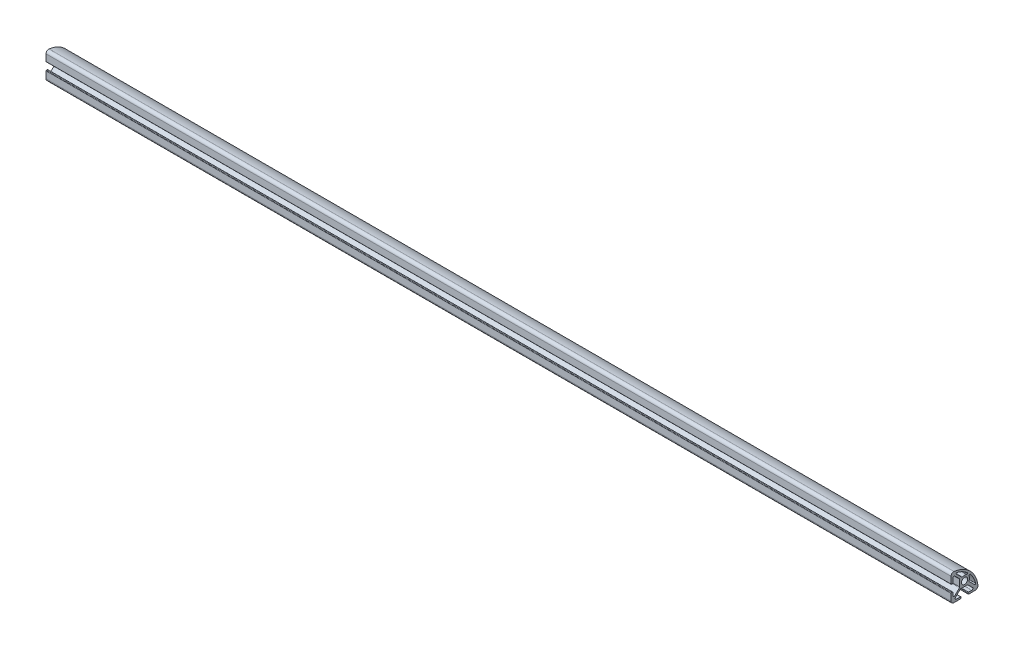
ISO-10303-21;
HEADER;
FILE_DESCRIPTION(('STEP AP214'),'2;1');
FILE_NAME('part.step','',(''),(''),'','','');
FILE_SCHEMA(('AUTOMOTIVE_DESIGN { 1 0 10303 214 1 1 1 1 }'));
ENDSEC;
DATA;
#1=APPLICATION_CONTEXT('core data for automotive mechanical design processes');
#2=APPLICATION_PROTOCOL_DEFINITION('international standard','automotive_design',2000,#1);
#3=PRODUCT_CONTEXT('',#1,'mechanical');
#4=PRODUCT('Part','Part','',(#3));
#5=PRODUCT_RELATED_PRODUCT_CATEGORY('part','',(#4));
#6=PRODUCT_DEFINITION_FORMATION('','',#4);
#7=PRODUCT_DEFINITION_CONTEXT('part definition',#1,'design');
#8=PRODUCT_DEFINITION('design','',#6,#7);
#9=PRODUCT_DEFINITION_SHAPE('','',#8);
#10=(LENGTH_UNIT() NAMED_UNIT(*) SI_UNIT(.MILLI.,.METRE.));
#11=(NAMED_UNIT(*) PLANE_ANGLE_UNIT() SI_UNIT($,.RADIAN.));
#12=(NAMED_UNIT(*) SI_UNIT($,.STERADIAN.) SOLID_ANGLE_UNIT());
#13=UNCERTAINTY_MEASURE_WITH_UNIT(LENGTH_MEASURE(1.E-05),#10,'distance_accuracy_value','');
#14=(GEOMETRIC_REPRESENTATION_CONTEXT(3) GLOBAL_UNCERTAINTY_ASSIGNED_CONTEXT((#13)) GLOBAL_UNIT_ASSIGNED_CONTEXT((#10,
#11,#12)) REPRESENTATION_CONTEXT('',''));
#15=CARTESIAN_POINT('',(0.,0.,0.));
#16=DIRECTION('',(0.,0.,1.));
#17=DIRECTION('',(1.,0.,0.));
#18=AXIS2_PLACEMENT_3D('',#15,#16,#17);
#19=CARTESIAN_POINT('',(1000.,-2.57513409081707,-5.52979967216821));
#20=DIRECTION('',(-1.,0.,0.));
#21=DIRECTION('',(0.,0.,1.));
#22=AXIS2_PLACEMENT_3D('',#19,#20,#21);
#23=CYLINDRICAL_SURFACE('',#22,0.699999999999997);
#24=CARTESIAN_POINT('',(0.,-2.57513409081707,-5.52979967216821));
#25=DIRECTION('',(1.,0.,0.));
#26=DIRECTION('',(0.,0.,1.));
#27=AXIS2_PLACEMENT_3D('',#24,#25,#26);
#28=CIRCLE('',#27,0.699999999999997);
#29=CARTESIAN_POINT('',(0.,-2.27962690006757,-4.89523249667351));
#30=VERTEX_POINT('',#29);
#31=CARTESIAN_POINT('',(0.,-3.07010883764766,-5.03482492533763));
#32=VERTEX_POINT('',#31);
#33=EDGE_CURVE('E690',#30,#32,#28,.T.);
#34=ORIENTED_EDGE('',*,*,#33,.F.);
#35=DIRECTION('',(-1.,0.,0.));
#36=VECTOR('',#35,1.);
#37=CARTESIAN_POINT('',(1000.,-2.27962690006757,-4.89523249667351));
#38=LINE('',#37,#36);
#39=CARTESIAN_POINT('',(1000.,-2.27962690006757,-4.89523249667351));
#40=VERTEX_POINT('',#39);
#41=EDGE_CURVE('E13',#40,#30,#38,.T.);
#42=ORIENTED_EDGE('',*,*,#41,.F.);
#43=CARTESIAN_POINT('',(1000.,-2.57513409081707,-5.52979967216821));
#44=DIRECTION('',(1.,0.,0.));
#45=DIRECTION('',(0.,0.,1.));
#46=AXIS2_PLACEMENT_3D('',#43,#44,#45);
#47=CIRCLE('',#46,0.699999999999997);
#48=CARTESIAN_POINT('',(1000.,-3.07010883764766,-5.03482492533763));
#49=VERTEX_POINT('',#48);
#50=EDGE_CURVE('E996',#40,#49,#47,.T.);
#51=ORIENTED_EDGE('',*,*,#50,.T.);
#52=DIRECTION('',(-1.,0.,0.));
#53=VECTOR('',#52,1.);
#54=CARTESIAN_POINT('',(1000.,-3.07010883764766,-5.03482492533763));
#55=LINE('',#54,#53);
#56=EDGE_CURVE('E181',#49,#32,#55,.T.);
#57=ORIENTED_EDGE('',*,*,#56,.T.);
#58=EDGE_LOOP('',(#34,#42,#51,#57));
#59=FACE_BOUND('',#58,.T.);
#60=ADVANCED_FACE('F162',(#59),#23,.F.);
#61=CARTESIAN_POINT('',(1000.,0.,0.));
#62=DIRECTION('',(-1.,0.,0.));
#63=DIRECTION('',(0.,0.,1.));
#64=AXIS2_PLACEMENT_3D('',#61,#62,#63);
#65=CYLINDRICAL_SURFACE('',#64,5.4);
#66=CARTESIAN_POINT('',(0.,0.,0.));
#67=DIRECTION('',(-1.,0.,0.));
#68=DIRECTION('',(0.,0.,1.));
#69=AXIS2_PLACEMENT_3D('',#66,#67,#68);
#70=CIRCLE('',#69,5.4);
#71=CARTESIAN_POINT('',(0.,2.18427664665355,-4.93851551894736));
#72=VERTEX_POINT('',#71);
#73=EDGE_CURVE('E692',#72,#30,#70,.T.);
#74=ORIENTED_EDGE('',*,*,#73,.F.);
#75=DIRECTION('',(-1.,0.,0.));
#76=VECTOR('',#75,1.);
#77=CARTESIAN_POINT('',(1000.,2.18427664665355,-4.93851551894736));
#78=LINE('',#77,#76);
#79=CARTESIAN_POINT('',(1000.,2.18427664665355,-4.93851551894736));
#80=VERTEX_POINT('',#79);
#81=EDGE_CURVE('E172',#80,#72,#78,.T.);
#82=ORIENTED_EDGE('',*,*,#81,.F.);
#83=CARTESIAN_POINT('',(1000.,0.,0.));
#84=DIRECTION('',(-1.,0.,0.));
#85=DIRECTION('',(0.,0.,1.));
#86=AXIS2_PLACEMENT_3D('',#83,#84,#85);
#87=CIRCLE('',#86,5.4);
#88=EDGE_CURVE('E998',#80,#40,#87,.T.);
#89=ORIENTED_EDGE('',*,*,#88,.T.);
#90=ORIENTED_EDGE('',*,*,#41,.T.);
#91=EDGE_LOOP('',(#74,#82,#89,#90));
#92=FACE_BOUND('',#91,.T.);
#93=ADVANCED_FACE('F1031',(#92),#65,.T.);
#94=CARTESIAN_POINT('',(1000.,2.4674236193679,-5.57869345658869));
#95=DIRECTION('',(-1.,0.,0.));
#96=DIRECTION('',(0.,0.,1.));
#97=AXIS2_PLACEMENT_3D('',#94,#95,#96);
#98=CYLINDRICAL_SURFACE('',#97,0.700000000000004);
#99=CARTESIAN_POINT('',(0.,2.4674236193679,-5.57869345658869));
#100=DIRECTION('',(1.,0.,0.));
#101=DIRECTION('',(0.,0.,-1.));
#102=AXIS2_PLACEMENT_3D('',#99,#100,#101);
#103=CIRCLE('',#102,0.700000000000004);
#104=CARTESIAN_POINT('',(0.,2.96239836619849,-5.0837187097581));
#105=VERTEX_POINT('',#104);
#106=EDGE_CURVE('E695',#105,#72,#103,.T.);
#107=ORIENTED_EDGE('',*,*,#106,.F.);
#108=DIRECTION('',(-1.,0.,0.));
#109=VECTOR('',#108,1.);
#110=CARTESIAN_POINT('',(1000.,2.96239836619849,-5.0837187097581));
#111=LINE('',#110,#109);
#112=CARTESIAN_POINT('',(1000.,2.96239836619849,-5.0837187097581));
#113=VERTEX_POINT('',#112);
#114=EDGE_CURVE('E727',#113,#105,#111,.T.);
#115=ORIENTED_EDGE('',*,*,#114,.F.);
#116=CARTESIAN_POINT('',(1000.,2.4674236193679,-5.57869345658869));
#117=DIRECTION('',(1.,0.,0.));
#118=DIRECTION('',(0.,0.,-1.));
#119=AXIS2_PLACEMENT_3D('',#116,#117,#118);
#120=CIRCLE('',#119,0.700000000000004);
#121=EDGE_CURVE('E1001',#113,#80,#120,.T.);
#122=ORIENTED_EDGE('',*,*,#121,.T.);
#123=ORIENTED_EDGE('',*,*,#81,.T.);
#124=EDGE_LOOP('',(#107,#115,#122,#123));
#125=FACE_BOUND('',#124,.T.);
#126=ADVANCED_FACE('F1036',(#125),#98,.F.);
#127=CARTESIAN_POINT('',(1000.,2.96239836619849,-5.0837187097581));
#128=DIRECTION('',(0.,-0.707106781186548,-0.707106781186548));
#129=DIRECTION('',(0.,0.707106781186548,-0.707106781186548));
#130=AXIS2_PLACEMENT_3D('',#127,#128,#129);
#131=PLANE('',#130);
#132=DIRECTION('',(0.,-0.707106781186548,0.707106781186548));
#133=VECTOR('',#132,1.);
#134=CARTESIAN_POINT('',(0.,2.96239836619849,-5.0837187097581));
#135=LINE('',#134,#133);
#136=CARTESIAN_POINT('',(0.,3.18057159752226,-5.30189194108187));
#137=VERTEX_POINT('',#136);
#138=EDGE_CURVE('E698',#137,#105,#135,.T.);
#139=ORIENTED_EDGE('',*,*,#138,.F.);
#140=DIRECTION('',(-1.,0.,0.));
#141=VECTOR('',#140,1.);
#142=CARTESIAN_POINT('',(1000.,3.18057159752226,-5.30189194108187));
#143=LINE('',#142,#141);
#144=CARTESIAN_POINT('',(1000.,3.18057159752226,-5.30189194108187));
#145=VERTEX_POINT('',#144);
#146=EDGE_CURVE('E725',#145,#137,#143,.T.);
#147=ORIENTED_EDGE('',*,*,#146,.F.);
#148=DIRECTION('',(0.,-0.707106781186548,0.707106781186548));
#149=VECTOR('',#148,1.);
#150=CARTESIAN_POINT('',(1000.,2.96239836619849,-5.0837187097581));
#151=LINE('',#150,#149);
#152=EDGE_CURVE('E1004',#145,#113,#151,.T.);
#153=ORIENTED_EDGE('',*,*,#152,.T.);
#154=ORIENTED_EDGE('',*,*,#114,.T.);
#155=EDGE_LOOP('',(#139,#147,#153,#154));
#156=FACE_BOUND('',#155,.T.);
#157=ADVANCED_FACE('F1661',(#156),#131,.T.);
#158=CARTESIAN_POINT('',(1000.,2.68559685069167,-5.79686668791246));
#159=DIRECTION('',(-1.,0.,0.));
#160=DIRECTION('',(0.,0.,1.));
#161=AXIS2_PLACEMENT_3D('',#158,#159,#160);
#162=CYLINDRICAL_SURFACE('',#161,0.700000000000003);
#163=CARTESIAN_POINT('',(0.,2.68559685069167,-5.79686668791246));
#164=DIRECTION('',(1.,0.,0.));
#165=DIRECTION('',(0.,0.,-1.));
#166=AXIS2_PLACEMENT_3D('',#163,#164,#165);
#167=CIRCLE('',#166,0.700000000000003);
#168=CARTESIAN_POINT('',(0.,3.17598206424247,-6.29638880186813));
#169=VERTEX_POINT('',#168);
#170=EDGE_CURVE('E701',#169,#137,#167,.T.);
#171=ORIENTED_EDGE('',*,*,#170,.F.);
#172=DIRECTION('',(-1.,0.,0.));
#173=VECTOR('',#172,1.);
#174=CARTESIAN_POINT('',(1000.,3.17598206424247,-6.29638880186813));
#175=LINE('',#174,#173);
#176=CARTESIAN_POINT('',(1000.,3.17598206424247,-6.29638880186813));
#177=VERTEX_POINT('',#176);
#178=EDGE_CURVE('E723',#177,#169,#175,.T.);
#179=ORIENTED_EDGE('',*,*,#178,.F.);
#180=CARTESIAN_POINT('',(1000.,2.68559685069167,-5.79686668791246));
#181=DIRECTION('',(1.,0.,0.));
#182=DIRECTION('',(0.,0.,-1.));
#183=AXIS2_PLACEMENT_3D('',#180,#181,#182);
#184=CIRCLE('',#183,0.700000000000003);
#185=EDGE_CURVE('E1007',#177,#145,#184,.T.);
#186=ORIENTED_EDGE('',*,*,#185,.T.);
#187=ORIENTED_EDGE('',*,*,#146,.T.);
#188=EDGE_LOOP('',(#171,#179,#186,#187));
#189=FACE_BOUND('',#188,.T.);
#190=ADVANCED_FACE('F1670',(#189),#162,.F.);
#191=CARTESIAN_POINT('',(1000.,3.17598206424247,-6.29638880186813));
#192=DIRECTION('',(0.,-0.660991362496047,0.7503935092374));
#193=DIRECTION('',(0.,-0.7503935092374,-0.660991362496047));
#194=AXIS2_PLACEMENT_3D('',#191,#192,#193);
#195=PLANE('',#194);
#196=DIRECTION('',(0.,0.750393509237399,0.660991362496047));
#197=VECTOR('',#196,1.);
#198=CARTESIAN_POINT('',(0.,3.17598206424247,-6.29638880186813));
#199=LINE('',#198,#197);
#200=CARTESIAN_POINT('',(0.,3.10095528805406,-6.36247686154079));
#201=VERTEX_POINT('',#200);
#202=EDGE_CURVE('E704',#201,#169,#199,.T.);
#203=ORIENTED_EDGE('',*,*,#202,.F.);
#204=DIRECTION('',(-1.,0.,0.));
#205=VECTOR('',#204,1.);
#206=CARTESIAN_POINT('',(1000.,3.10095528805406,-6.36247686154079));
#207=LINE('',#206,#205);
#208=CARTESIAN_POINT('',(1000.,3.10095528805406,-6.36247686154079));
#209=VERTEX_POINT('',#208);
#210=EDGE_CURVE('E721',#209,#201,#207,.T.);
#211=ORIENTED_EDGE('',*,*,#210,.F.);
#212=DIRECTION('',(0.,0.750393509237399,0.660991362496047));
#213=VECTOR('',#212,1.);
#214=CARTESIAN_POINT('',(1000.,3.17598206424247,-6.29638880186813));
#215=LINE('',#214,#213);
#216=EDGE_CURVE('E1010',#209,#177,#215,.T.);
#217=ORIENTED_EDGE('',*,*,#216,.T.);
#218=ORIENTED_EDGE('',*,*,#178,.T.);
#219=EDGE_LOOP('',(#203,#211,#217,#218));
#220=FACE_BOUND('',#219,.T.);
#221=ADVANCED_FACE('F1680',(#220),#195,.T.);
#222=CARTESIAN_POINT('',(1000.,-15.,15.0000000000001));
#223=DIRECTION('',(-1.,0.,0.));
#224=DIRECTION('',(0.,0.,1.));
#225=AXIS2_PLACEMENT_3D('',#222,#223,#224);
#226=CYLINDRICAL_SURFACE('',#225,28.);
#227=CARTESIAN_POINT('',(0.,-15.,15.0000000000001));
#228=DIRECTION('',(1.,0.,0.));
#229=DIRECTION('',(0.,0.,-1.));
#230=AXIS2_PLACEMENT_3D('',#227,#228,#229);
#231=CIRCLE('',#230,28.);
#232=CARTESIAN_POINT('',(0.,-8.36641821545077,-12.2028600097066));
#233=VERTEX_POINT('',#232);
#234=EDGE_CURVE('E707',#233,#201,#231,.T.);
#235=ORIENTED_EDGE('',*,*,#234,.F.);
#236=DIRECTION('',(-1.,0.,0.));
#237=VECTOR('',#236,1.);
#238=CARTESIAN_POINT('',(1000.,-8.36641821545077,-12.2028600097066));
#239=LINE('',#238,#237);
#240=CARTESIAN_POINT('',(1000.,-8.36641821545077,-12.2028600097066));
#241=VERTEX_POINT('',#240);
#242=EDGE_CURVE('E556',#241,#233,#239,.T.);
#243=ORIENTED_EDGE('',*,*,#242,.F.);
#244=CARTESIAN_POINT('',(1000.,-15.,15.0000000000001));
#245=DIRECTION('',(1.,0.,0.));
#246=DIRECTION('',(0.,0.,-1.));
#247=AXIS2_PLACEMENT_3D('',#244,#245,#246);
#248=CIRCLE('',#247,28.);
#249=EDGE_CURVE('E567',#241,#209,#248,.T.);
#250=ORIENTED_EDGE('',*,*,#249,.T.);
#251=ORIENTED_EDGE('',*,*,#210,.T.);
#252=EDGE_LOOP('',(#235,#243,#250,#251));
#253=FACE_BOUND('',#252,.T.);
#254=ADVANCED_FACE('F1014',(#253),#226,.F.);
#255=CARTESIAN_POINT('',(1000.,-8.36641821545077,-12.2028600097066));
#256=DIRECTION('',(0.,-0.218217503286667,0.975900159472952));
#257=DIRECTION('',(0.,-0.975900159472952,-0.218217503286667));
#258=AXIS2_PLACEMENT_3D('',#255,#256,#257);
#259=PLANE('',#258);
#260=DIRECTION('',(0.,0.975900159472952,0.218217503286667));
#261=VECTOR('',#260,1.);
#262=CARTESIAN_POINT('',(0.,-8.36641821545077,-12.2028600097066));
#263=LINE('',#262,#261);
#264=CARTESIAN_POINT('',(0.,-8.46399187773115,-12.224678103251));
#265=VERTEX_POINT('',#264);
#266=EDGE_CURVE('E552',#265,#233,#263,.T.);
#267=ORIENTED_EDGE('',*,*,#266,.F.);
#268=DIRECTION('',(-1.,0.,0.));
#269=VECTOR('',#268,1.);
#270=CARTESIAN_POINT('',(1000.,-8.46399187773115,-12.224678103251));
#271=LINE('',#270,#269);
#272=CARTESIAN_POINT('',(1000.,-8.46399187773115,-12.224678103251));
#273=VERTEX_POINT('',#272);
#274=EDGE_CURVE('E547',#273,#265,#271,.T.);
#275=ORIENTED_EDGE('',*,*,#274,.F.);
#276=DIRECTION('',(0.,0.975900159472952,0.218217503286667));
#277=VECTOR('',#276,1.);
#278=CARTESIAN_POINT('',(1000.,-8.36641821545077,-12.2028600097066));
#279=LINE('',#278,#277);
#280=EDGE_CURVE('E550',#273,#241,#279,.T.);
#281=ORIENTED_EDGE('',*,*,#280,.T.);
#282=ORIENTED_EDGE('',*,*,#242,.T.);
#283=EDGE_LOOP('',(#267,#275,#281,#282));
#284=FACE_BOUND('',#283,.T.);
#285=ADVANCED_FACE('F549',(#284),#259,.T.);
#286=CARTESIAN_POINT('',(1000.,-8.57963017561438,-11.5342957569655));
#287=DIRECTION('',(-1.,0.,0.));
#288=DIRECTION('',(0.,0.,1.));
#289=AXIS2_PLACEMENT_3D('',#286,#287,#288);
#290=CYLINDRICAL_SURFACE('',#289,0.700000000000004);
#291=CARTESIAN_POINT('',(0.,-8.57963017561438,-11.5342957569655));
#292=DIRECTION('',(1.,0.,0.));
#293=DIRECTION('',(0.,0.,1.));
#294=AXIS2_PLACEMENT_3D('',#291,#292,#293);
#295=CIRCLE('',#294,0.700000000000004);
#296=CARTESIAN_POINT('',(0.,-9.07460492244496,-11.0393210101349));
#297=VERTEX_POINT('',#296);
#298=EDGE_CURVE('E711',#297,#265,#295,.T.);
#299=ORIENTED_EDGE('',*,*,#298,.F.);
#300=DIRECTION('',(-1.,0.,0.));
#301=VECTOR('',#300,1.);
#302=CARTESIAN_POINT('',(1000.,-9.07460492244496,-11.0393210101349));
#303=LINE('',#302,#301);
#304=CARTESIAN_POINT('',(1000.,-9.07460492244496,-11.0393210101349));
#305=VERTEX_POINT('',#304);
#306=EDGE_CURVE('E362',#305,#297,#303,.T.);
#307=ORIENTED_EDGE('',*,*,#306,.F.);
#308=CARTESIAN_POINT('',(1000.,-8.57963017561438,-11.5342957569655));
#309=DIRECTION('',(1.,0.,0.));
#310=DIRECTION('',(0.,0.,1.));
#311=AXIS2_PLACEMENT_3D('',#308,#309,#310);
#312=CIRCLE('',#311,0.700000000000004);
#313=EDGE_CURVE('E564',#305,#273,#312,.T.);
#314=ORIENTED_EDGE('',*,*,#313,.T.);
#315=ORIENTED_EDGE('',*,*,#274,.T.);
#316=EDGE_LOOP('',(#299,#307,#314,#315));
#317=FACE_BOUND('',#316,.T.);
#318=ADVANCED_FACE('F569',(#317),#290,.F.);
#319=CARTESIAN_POINT('',(1000.,11.5342957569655,8.57963017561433));
#320=DIRECTION('',(-1.,0.,0.));
#321=DIRECTION('',(0.,0.,1.));
#322=AXIS2_PLACEMENT_3D('',#319,#320,#321);
#323=CYLINDRICAL_SURFACE('',#322,0.700000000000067);
#324=CARTESIAN_POINT('',(0.,11.5342957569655,8.57963017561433));
#325=DIRECTION('',(1.,0.,0.));
#326=DIRECTION('',(0.,0.,-1.));
#327=AXIS2_PLACEMENT_3D('',#324,#325,#326);
#328=CIRCLE('',#327,0.700000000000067);
#329=CARTESIAN_POINT('',(0.,12.224678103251,8.4639918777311));
#330=VERTEX_POINT('',#329);
#331=CARTESIAN_POINT('',(0.,11.0393210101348,9.07460492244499));
#332=VERTEX_POINT('',#331);
#333=EDGE_CURVE('E660',#330,#332,#328,.T.);
#334=ORIENTED_EDGE('',*,*,#333,.F.);
#335=DIRECTION('',(-1.,0.,0.));
#336=VECTOR('',#335,1.);
#337=CARTESIAN_POINT('',(1000.,12.224678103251,8.4639918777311));
#338=LINE('',#337,#336);
#339=CARTESIAN_POINT('',(1000.,12.224678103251,8.4639918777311));
#340=VERTEX_POINT('',#339);
#341=EDGE_CURVE('E718',#340,#330,#338,.T.);
#342=ORIENTED_EDGE('',*,*,#341,.F.);
#343=CARTESIAN_POINT('',(1000.,11.5342957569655,8.57963017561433));
#344=DIRECTION('',(1.,0.,0.));
#345=DIRECTION('',(0.,0.,-1.));
#346=AXIS2_PLACEMENT_3D('',#343,#344,#345);
#347=CIRCLE('',#346,0.700000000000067);
#348=CARTESIAN_POINT('',(1000.,11.0393210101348,9.07460492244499));
#349=VERTEX_POINT('',#348);
#350=EDGE_CURVE('E966',#340,#349,#347,.T.);
#351=ORIENTED_EDGE('',*,*,#350,.T.);
#352=DIRECTION('',(-1.,0.,0.));
#353=VECTOR('',#352,1.);
#354=CARTESIAN_POINT('',(1000.,11.0393210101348,9.07460492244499));
#355=LINE('',#354,#353);
#356=EDGE_CURVE('E730',#349,#332,#355,.T.);
#357=ORIENTED_EDGE('',*,*,#356,.T.);
#358=EDGE_LOOP('',(#334,#342,#351,#357));
#359=FACE_BOUND('',#358,.T.);
#360=ADVANCED_FACE('F1077',(#359),#323,.F.);
#361=CARTESIAN_POINT('',(1000.,12.224678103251,8.4639918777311));
#362=DIRECTION('',(0.,-0.97590015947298,0.218217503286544));
#363=DIRECTION('',(0.,-0.218217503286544,-0.97590015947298));
#364=AXIS2_PLACEMENT_3D('',#361,#362,#363);
#365=PLANE('',#364);
#366=DIRECTION('',(0.,0.218217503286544,0.97590015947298));
#367=VECTOR('',#366,1.);
#368=CARTESIAN_POINT('',(0.,12.224678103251,8.4639918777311));
#369=LINE('',#368,#367);
#370=CARTESIAN_POINT('',(0.,12.2028600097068,8.36641821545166));
#371=VERTEX_POINT('',#370);
#372=EDGE_CURVE('E663',#371,#330,#369,.T.);
#373=ORIENTED_EDGE('',*,*,#372,.F.);
#374=DIRECTION('',(-1.,0.,0.));
#375=VECTOR('',#374,1.);
#376=CARTESIAN_POINT('',(1000.,12.2028600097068,8.36641821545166));
#377=LINE('',#376,#375);
#378=CARTESIAN_POINT('',(1000.,12.2028600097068,8.36641821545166));
#379=VERTEX_POINT('',#378);
#380=EDGE_CURVE('E746',#379,#371,#377,.T.);
#381=ORIENTED_EDGE('',*,*,#380,.F.);
#382=DIRECTION('',(0.,0.218217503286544,0.97590015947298));
#383=VECTOR('',#382,1.);
#384=CARTESIAN_POINT('',(1000.,12.224678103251,8.4639918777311));
#385=LINE('',#384,#383);
#386=EDGE_CURVE('E969',#379,#340,#385,.T.);
#387=ORIENTED_EDGE('',*,*,#386,.T.);
#388=ORIENTED_EDGE('',*,*,#341,.T.);
#389=EDGE_LOOP('',(#373,#381,#387,#388));
#390=FACE_BOUND('',#389,.T.);
#391=ADVANCED_FACE('F1073',(#390),#365,.T.);
#392=CARTESIAN_POINT('',(1000.,-15.,15.0000000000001));
#393=DIRECTION('',(-1.,0.,0.));
#394=DIRECTION('',(0.,0.,1.));
#395=AXIS2_PLACEMENT_3D('',#392,#393,#394);
#396=CYLINDRICAL_SURFACE('',#395,28.);
#397=CARTESIAN_POINT('',(0.,-15.,15.0000000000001));
#398=DIRECTION('',(1.,0.,0.));
#399=DIRECTION('',(0.,0.,1.));
#400=AXIS2_PLACEMENT_3D('',#397,#398,#399);
#401=CIRCLE('',#400,28.);
#402=CARTESIAN_POINT('',(0.,6.36247686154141,-3.10095528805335));
#403=VERTEX_POINT('',#402);
#404=EDGE_CURVE('E666',#403,#371,#401,.T.);
#405=ORIENTED_EDGE('',*,*,#404,.F.);
#406=DIRECTION('',(-1.,0.,0.));
#407=VECTOR('',#406,1.);
#408=CARTESIAN_POINT('',(1000.,6.36247686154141,-3.10095528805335));
#409=LINE('',#408,#407);
#410=CARTESIAN_POINT('',(1000.,6.36247686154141,-3.10095528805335));
#411=VERTEX_POINT('',#410);
#412=EDGE_CURVE('E744',#411,#403,#409,.T.);
#413=ORIENTED_EDGE('',*,*,#412,.F.);
#414=CARTESIAN_POINT('',(1000.,-15.,15.0000000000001));
#415=DIRECTION('',(1.,0.,0.));
#416=DIRECTION('',(0.,0.,1.));
#417=AXIS2_PLACEMENT_3D('',#414,#415,#416);
#418=CIRCLE('',#417,28.);
#419=EDGE_CURVE('E972',#411,#379,#418,.T.);
#420=ORIENTED_EDGE('',*,*,#419,.T.);
#421=ORIENTED_EDGE('',*,*,#380,.T.);
#422=EDGE_LOOP('',(#405,#413,#420,#421));
#423=FACE_BOUND('',#422,.T.);
#424=ADVANCED_FACE('F1069',(#423),#396,.F.);
#425=CARTESIAN_POINT('',(1000.,6.36247686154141,-3.10095528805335));
#426=DIRECTION('',(0.,-0.750393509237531,0.660991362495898));
#427=DIRECTION('',(0.,-0.660991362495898,-0.750393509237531));
#428=AXIS2_PLACEMENT_3D('',#425,#426,#427);
#429=PLANE('',#428);
#430=DIRECTION('',(0.,0.660991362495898,0.750393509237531));
#431=VECTOR('',#430,1.);
#432=CARTESIAN_POINT('',(0.,6.36247686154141,-3.10095528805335));
#433=LINE('',#432,#431);
#434=CARTESIAN_POINT('',(0.,6.29638880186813,-3.17598206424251));
#435=VERTEX_POINT('',#434);
#436=EDGE_CURVE('E669',#435,#403,#433,.T.);
#437=ORIENTED_EDGE('',*,*,#436,.F.);
#438=DIRECTION('',(-1.,0.,0.));
#439=VECTOR('',#438,1.);
#440=CARTESIAN_POINT('',(1000.,6.29638880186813,-3.17598206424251));
#441=LINE('',#440,#439);
#442=CARTESIAN_POINT('',(1000.,6.29638880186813,-3.17598206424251));
#443=VERTEX_POINT('',#442);
#444=EDGE_CURVE('E742',#443,#435,#441,.T.);
#445=ORIENTED_EDGE('',*,*,#444,.F.);
#446=DIRECTION('',(0.,0.660991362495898,0.750393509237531));
#447=VECTOR('',#446,1.);
#448=CARTESIAN_POINT('',(1000.,6.36247686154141,-3.10095528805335));
#449=LINE('',#448,#447);
#450=EDGE_CURVE('E975',#443,#411,#449,.T.);
#451=ORIENTED_EDGE('',*,*,#450,.T.);
#452=ORIENTED_EDGE('',*,*,#412,.T.);
#453=EDGE_LOOP('',(#437,#445,#451,#452));
#454=FACE_BOUND('',#453,.T.);
#455=ADVANCED_FACE('F1065',(#454),#429,.T.);
#456=CARTESIAN_POINT('',(1000.,5.79686668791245,-2.6855968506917));
#457=DIRECTION('',(-1.,0.,0.));
#458=DIRECTION('',(0.,0.,1.));
#459=AXIS2_PLACEMENT_3D('',#456,#457,#458);
#460=CYLINDRICAL_SURFACE('',#459,0.700000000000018);
#461=CARTESIAN_POINT('',(0.,5.79686668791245,-2.6855968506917));
#462=DIRECTION('',(1.,0.,0.));
#463=DIRECTION('',(0.,0.,1.));
#464=AXIS2_PLACEMENT_3D('',#461,#462,#463);
#465=CIRCLE('',#464,0.700000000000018);
#466=CARTESIAN_POINT('',(0.,5.30189194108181,-3.18057159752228));
#467=VERTEX_POINT('',#466);
#468=EDGE_CURVE('E672',#467,#435,#465,.T.);
#469=ORIENTED_EDGE('',*,*,#468,.F.);
#470=DIRECTION('',(-1.,0.,0.));
#471=VECTOR('',#470,1.);
#472=CARTESIAN_POINT('',(1000.,5.30189194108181,-3.18057159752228));
#473=LINE('',#472,#471);
#474=CARTESIAN_POINT('',(1000.,5.30189194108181,-3.18057159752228));
#475=VERTEX_POINT('',#474);
#476=EDGE_CURVE('E740',#475,#467,#473,.T.);
#477=ORIENTED_EDGE('',*,*,#476,.F.);
#478=CARTESIAN_POINT('',(1000.,5.79686668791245,-2.6855968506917));
#479=DIRECTION('',(1.,0.,0.));
#480=DIRECTION('',(0.,0.,1.));
#481=AXIS2_PLACEMENT_3D('',#478,#479,#480);
#482=CIRCLE('',#481,0.700000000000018);
#483=EDGE_CURVE('E978',#475,#443,#482,.T.);
#484=ORIENTED_EDGE('',*,*,#483,.T.);
#485=ORIENTED_EDGE('',*,*,#444,.T.);
#486=EDGE_LOOP('',(#469,#477,#484,#485));
#487=FACE_BOUND('',#486,.T.);
#488=ADVANCED_FACE('F1061',(#487),#460,.F.);
#489=CARTESIAN_POINT('',(1000.,5.08371870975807,-2.96239836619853));
#490=DIRECTION('',(0.,0.70710678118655,0.707106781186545));
#491=DIRECTION('',(0.,-0.707106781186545,0.70710678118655));
#492=AXIS2_PLACEMENT_3D('',#489,#490,#491);
#493=PLANE('',#492);
#494=DIRECTION('',(0.,0.707106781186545,-0.70710678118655));
#495=VECTOR('',#494,1.);
#496=CARTESIAN_POINT('',(0.,5.08371870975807,-2.96239836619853));
#497=LINE('',#496,#495);
#498=CARTESIAN_POINT('',(0.,5.08371870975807,-2.96239836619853));
#499=VERTEX_POINT('',#498);
#500=EDGE_CURVE('E675',#499,#467,#497,.T.);
#501=ORIENTED_EDGE('',*,*,#500,.F.);
#502=DIRECTION('',(-1.,0.,0.));
#503=VECTOR('',#502,1.);
#504=CARTESIAN_POINT('',(1000.,5.08371870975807,-2.96239836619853));
#505=LINE('',#504,#503);
#506=CARTESIAN_POINT('',(1000.,5.08371870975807,-2.96239836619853));
#507=VERTEX_POINT('',#506);
#508=EDGE_CURVE('E738',#507,#499,#505,.T.);
#509=ORIENTED_EDGE('',*,*,#508,.F.);
#510=DIRECTION('',(0.,0.707106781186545,-0.70710678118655));
#511=VECTOR('',#510,1.);
#512=CARTESIAN_POINT('',(1000.,5.08371870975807,-2.96239836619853));
#513=LINE('',#512,#511);
#514=EDGE_CURVE('E981',#507,#475,#513,.T.);
#515=ORIENTED_EDGE('',*,*,#514,.T.);
#516=ORIENTED_EDGE('',*,*,#476,.T.);
#517=EDGE_LOOP('',(#501,#509,#515,#516));
#518=FACE_BOUND('',#517,.T.);
#519=ADVANCED_FACE('F1057',(#518),#493,.T.);
#520=CARTESIAN_POINT('',(1000.,5.57869345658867,-2.46742361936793));
#521=DIRECTION('',(-1.,0.,0.));
#522=DIRECTION('',(0.,0.,1.));
#523=AXIS2_PLACEMENT_3D('',#520,#521,#522);
#524=CYLINDRICAL_SURFACE('',#523,0.700000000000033);
#525=CARTESIAN_POINT('',(0.,5.57869345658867,-2.46742361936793));
#526=DIRECTION('',(1.,0.,0.));
#527=DIRECTION('',(0.,0.,1.));
#528=AXIS2_PLACEMENT_3D('',#525,#526,#527);
#529=CIRCLE('',#528,0.700000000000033);
#530=CARTESIAN_POINT('',(0.,4.93851551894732,-2.18427664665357));
#531=VERTEX_POINT('',#530);
#532=EDGE_CURVE('E678',#531,#499,#529,.T.);
#533=ORIENTED_EDGE('',*,*,#532,.F.);
#534=DIRECTION('',(-1.,0.,0.));
#535=VECTOR('',#534,1.);
#536=CARTESIAN_POINT('',(1000.,4.93851551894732,-2.18427664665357));
#537=LINE('',#536,#535);
#538=CARTESIAN_POINT('',(1000.,4.93851551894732,-2.18427664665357));
#539=VERTEX_POINT('',#538);
#540=EDGE_CURVE('E736',#539,#531,#537,.T.);
#541=ORIENTED_EDGE('',*,*,#540,.F.);
#542=CARTESIAN_POINT('',(1000.,5.57869345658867,-2.46742361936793));
#543=DIRECTION('',(1.,0.,0.));
#544=DIRECTION('',(0.,0.,1.));
#545=AXIS2_PLACEMENT_3D('',#542,#543,#544);
#546=CIRCLE('',#545,0.700000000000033);
#547=EDGE_CURVE('E984',#539,#507,#546,.T.);
#548=ORIENTED_EDGE('',*,*,#547,.T.);
#549=ORIENTED_EDGE('',*,*,#508,.T.);
#550=EDGE_LOOP('',(#533,#541,#548,#549));
#551=FACE_BOUND('',#550,.T.);
#552=ADVANCED_FACE('F1053',(#551),#524,.F.);
#553=CARTESIAN_POINT('',(1000.,0.,0.));
#554=DIRECTION('',(-1.,0.,0.));
#555=DIRECTION('',(0.,0.,1.));
#556=AXIS2_PLACEMENT_3D('',#553,#554,#555);
#557=CYLINDRICAL_SURFACE('',#556,5.39999999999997);
#558=CARTESIAN_POINT('',(0.,0.,0.));
#559=DIRECTION('',(-1.,0.,0.));
#560=DIRECTION('',(0.,0.,-1.));
#561=AXIS2_PLACEMENT_3D('',#558,#559,#560);
#562=CIRCLE('',#561,5.39999999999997);
#563=CARTESIAN_POINT('',(0.,4.89523249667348,2.27962690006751));
#564=VERTEX_POINT('',#563);
#565=EDGE_CURVE('E681',#564,#531,#562,.T.);
#566=ORIENTED_EDGE('',*,*,#565,.F.);
#567=DIRECTION('',(-1.,0.,0.));
#568=VECTOR('',#567,1.);
#569=CARTESIAN_POINT('',(1000.,4.89523249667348,2.27962690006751));
#570=LINE('',#569,#568);
#571=CARTESIAN_POINT('',(1000.,4.89523249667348,2.27962690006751));
#572=VERTEX_POINT('',#571);
#573=EDGE_CURVE('E734',#572,#564,#570,.T.);
#574=ORIENTED_EDGE('',*,*,#573,.F.);
#575=CARTESIAN_POINT('',(1000.,0.,0.));
#576=DIRECTION('',(-1.,0.,0.));
#577=DIRECTION('',(0.,0.,-1.));
#578=AXIS2_PLACEMENT_3D('',#575,#576,#577);
#579=CIRCLE('',#578,5.39999999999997);
#580=EDGE_CURVE('E987',#572,#539,#579,.T.);
#581=ORIENTED_EDGE('',*,*,#580,.T.);
#582=ORIENTED_EDGE('',*,*,#540,.T.);
#583=EDGE_LOOP('',(#566,#574,#581,#582));
#584=FACE_BOUND('',#583,.T.);
#585=ADVANCED_FACE('F1049',(#584),#557,.T.);
#586=CARTESIAN_POINT('',(1000.,5.52979967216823,2.57513409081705));
#587=DIRECTION('',(-1.,0.,0.));
#588=DIRECTION('',(0.,0.,1.));
#589=AXIS2_PLACEMENT_3D('',#586,#587,#588);
#590=CYLINDRICAL_SURFACE('',#589,0.700000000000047);
#591=CARTESIAN_POINT('',(0.,5.52979967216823,2.57513409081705));
#592=DIRECTION('',(1.,0.,0.));
#593=DIRECTION('',(0.,0.,-1.));
#594=AXIS2_PLACEMENT_3D('',#591,#592,#593);
#595=CIRCLE('',#594,0.700000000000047);
#596=CARTESIAN_POINT('',(0.,5.0348249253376,3.07010883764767));
#597=VERTEX_POINT('',#596);
#598=EDGE_CURVE('E684',#597,#564,#595,.T.);
#599=ORIENTED_EDGE('',*,*,#598,.F.);
#600=DIRECTION('',(-1.,0.,0.));
#601=VECTOR('',#600,1.);
#602=CARTESIAN_POINT('',(1000.,5.0348249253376,3.07010883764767));
#603=LINE('',#602,#601);
#604=CARTESIAN_POINT('',(1000.,5.0348249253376,3.07010883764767));
#605=VERTEX_POINT('',#604);
#606=EDGE_CURVE('E732',#605,#597,#603,.T.);
#607=ORIENTED_EDGE('',*,*,#606,.F.);
#608=CARTESIAN_POINT('',(1000.,5.52979967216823,2.57513409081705));
#609=DIRECTION('',(1.,0.,0.));
#610=DIRECTION('',(0.,0.,-1.));
#611=AXIS2_PLACEMENT_3D('',#608,#609,#610);
#612=CIRCLE('',#611,0.700000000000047);
#613=EDGE_CURVE('E990',#605,#572,#612,.T.);
#614=ORIENTED_EDGE('',*,*,#613,.T.);
#615=ORIENTED_EDGE('',*,*,#573,.T.);
#616=EDGE_LOOP('',(#599,#607,#614,#615));
#617=FACE_BOUND('',#616,.T.);
#618=ADVANCED_FACE('F1046',(#617),#590,.F.);
#619=CARTESIAN_POINT('',(1000.,4.49999999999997,14.5));
#620=DIRECTION('',(-1.,0.,0.));
#621=DIRECTION('',(0.,0.,1.));
#622=AXIS2_PLACEMENT_3D('',#619,#620,#621);
#623=CYLINDRICAL_SURFACE('',#622,0.500000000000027);
#624=CARTESIAN_POINT('',(0.,4.49999999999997,14.5));
#625=DIRECTION('',(1.,0.,0.));
#626=DIRECTION('',(0.,0.,-1.));
#627=AXIS2_PLACEMENT_3D('',#624,#625,#626);
#628=CIRCLE('',#627,0.500000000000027);
#629=CARTESIAN_POINT('',(0.,4.49999999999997,15.));
#630=VERTEX_POINT('',#629);
#631=CARTESIAN_POINT('',(0.,3.99999999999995,14.5000000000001));
#632=VERTEX_POINT('',#631);
#633=EDGE_CURVE('E579',#630,#632,#628,.T.);
#634=ORIENTED_EDGE('',*,*,#633,.T.);
#635=DIRECTION('',(-1.,0.,0.));
#636=VECTOR('',#635,1.);
#637=CARTESIAN_POINT('',(1000.,3.99999999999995,14.5000000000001));
#638=LINE('',#637,#636);
#639=CARTESIAN_POINT('',(1000.,3.99999999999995,14.5000000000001));
#640=VERTEX_POINT('',#639);
#641=EDGE_CURVE('E166',#640,#632,#638,.T.);
#642=ORIENTED_EDGE('',*,*,#641,.F.);
#643=CARTESIAN_POINT('',(1000.,4.49999999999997,14.5));
#644=DIRECTION('',(1.,0.,0.));
#645=DIRECTION('',(0.,0.,-1.));
#646=AXIS2_PLACEMENT_3D('',#643,#644,#645);
#647=CIRCLE('',#646,0.500000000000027);
#648=CARTESIAN_POINT('',(1000.,4.49999999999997,15.));
#649=VERTEX_POINT('',#648);
#650=EDGE_CURVE('E1865',#649,#640,#647,.T.);
#651=ORIENTED_EDGE('',*,*,#650,.F.);
#652=DIRECTION('',(-1.,0.,0.));
#653=VECTOR('',#652,1.);
#654=CARTESIAN_POINT('',(1000.,4.49999999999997,15.));
#655=LINE('',#654,#653);
#656=EDGE_CURVE('E572',#649,#630,#655,.T.);
#657=ORIENTED_EDGE('',*,*,#656,.T.);
#658=EDGE_LOOP('',(#634,#642,#651,#657));
#659=FACE_BOUND('',#658,.T.);
#660=ADVANCED_FACE('F871',(#659),#623,.T.);
#661=CARTESIAN_POINT('',(1000.,3.99999999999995,14.5000000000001));
#662=DIRECTION('',(0.,1.,0.));
#663=DIRECTION('',(0.,0.,1.));
#664=AXIS2_PLACEMENT_3D('',#661,#662,#663);
#665=PLANE('',#664);
#666=DIRECTION('',(0.,0.,-1.));
#667=VECTOR('',#666,1.);
#668=CARTESIAN_POINT('',(0.,3.99999999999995,14.5000000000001));
#669=LINE('',#668,#667);
#670=CARTESIAN_POINT('',(0.,3.99999999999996,13.5000000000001));
#671=VERTEX_POINT('',#670);
#672=EDGE_CURVE('E582',#632,#671,#669,.T.);
#673=ORIENTED_EDGE('',*,*,#672,.T.);
#674=DIRECTION('',(-1.,0.,0.));
#675=VECTOR('',#674,1.);
#676=CARTESIAN_POINT('',(1000.,3.99999999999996,13.5000000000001));
#677=LINE('',#676,#675);
#678=CARTESIAN_POINT('',(1000.,3.99999999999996,13.5000000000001));
#679=VERTEX_POINT('',#678);
#680=EDGE_CURVE('E861',#679,#671,#677,.T.);
#681=ORIENTED_EDGE('',*,*,#680,.F.);
#682=DIRECTION('',(0.,0.,-1.));
#683=VECTOR('',#682,1.);
#684=CARTESIAN_POINT('',(1000.,3.99999999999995,14.5000000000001));
#685=LINE('',#684,#683);
#686=EDGE_CURVE('E375',#640,#679,#685,.T.);
#687=ORIENTED_EDGE('',*,*,#686,.F.);
#688=ORIENTED_EDGE('',*,*,#641,.T.);
#689=EDGE_LOOP('',(#673,#681,#687,#688));
#690=FACE_BOUND('',#689,.T.);
#691=ADVANCED_FACE('F867',(#690),#665,.F.);
#692=CARTESIAN_POINT('',(1000.,4.49999999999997,13.5));
#693=DIRECTION('',(-1.,0.,0.));
#694=DIRECTION('',(0.,0.,1.));
#695=AXIS2_PLACEMENT_3D('',#692,#693,#694);
#696=CYLINDRICAL_SURFACE('',#695,0.500000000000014);
#697=CARTESIAN_POINT('',(0.,4.49999999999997,13.5));
#698=DIRECTION('',(1.,0.,0.));
#699=DIRECTION('',(0.,0.,-1.));
#700=AXIS2_PLACEMENT_3D('',#697,#698,#699);
#701=CIRCLE('',#700,0.500000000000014);
#702=CARTESIAN_POINT('',(0.,4.49999999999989,13.));
#703=VERTEX_POINT('',#702);
#704=EDGE_CURVE('E584',#671,#703,#701,.T.);
#705=ORIENTED_EDGE('',*,*,#704,.T.);
#706=DIRECTION('',(-1.,0.,0.));
#707=VECTOR('',#706,1.);
#708=CARTESIAN_POINT('',(1000.,4.49999999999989,13.));
#709=LINE('',#708,#707);
#710=CARTESIAN_POINT('',(1000.,4.49999999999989,13.));
#711=VERTEX_POINT('',#710);
#712=EDGE_CURVE('E859',#711,#703,#709,.T.);
#713=ORIENTED_EDGE('',*,*,#712,.F.);
#714=CARTESIAN_POINT('',(1000.,4.49999999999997,13.5));
#715=DIRECTION('',(1.,0.,0.));
#716=DIRECTION('',(0.,0.,-1.));
#717=AXIS2_PLACEMENT_3D('',#714,#715,#716);
#718=CIRCLE('',#717,0.500000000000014);
#719=EDGE_CURVE('E890',#679,#711,#718,.T.);
#720=ORIENTED_EDGE('',*,*,#719,.F.);
#721=ORIENTED_EDGE('',*,*,#680,.T.);
#722=EDGE_LOOP('',(#705,#713,#720,#721));
#723=FACE_BOUND('',#722,.T.);
#724=ADVANCED_FACE('F881',(#723),#696,.T.);
#725=CARTESIAN_POINT('',(1000.,4.49999999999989,13.));
#726=DIRECTION('',(0.,0.,1.));
#727=DIRECTION('',(0.,-1.,0.));
#728=AXIS2_PLACEMENT_3D('',#725,#726,#727);
#729=PLANE('',#728);
#730=DIRECTION('',(0.,1.,0.));
#731=VECTOR('',#730,1.);
#732=CARTESIAN_POINT('',(0.,4.49999999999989,13.));
#733=LINE('',#732,#731);
#734=CARTESIAN_POINT('',(0.,9.10225830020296,13.));
#735=VERTEX_POINT('',#734);
#736=EDGE_CURVE('E586',#703,#735,#733,.T.);
#737=ORIENTED_EDGE('',*,*,#736,.T.);
#738=DIRECTION('',(-1.,0.,0.));
#739=VECTOR('',#738,1.);
#740=CARTESIAN_POINT('',(1000.,9.10225830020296,13.));
#741=LINE('',#740,#739);
#742=CARTESIAN_POINT('',(1000.,9.10225830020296,13.));
#743=VERTEX_POINT('',#742);
#744=EDGE_CURVE('E856',#743,#735,#741,.T.);
#745=ORIENTED_EDGE('',*,*,#744,.F.);
#746=DIRECTION('',(0.,1.,0.));
#747=VECTOR('',#746,1.);
#748=CARTESIAN_POINT('',(1000.,4.49999999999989,13.));
#749=LINE('',#748,#747);
#750=EDGE_CURVE('E886',#711,#743,#749,.T.);
#751=ORIENTED_EDGE('',*,*,#750,.F.);
#752=ORIENTED_EDGE('',*,*,#712,.T.);
#753=EDGE_LOOP('',(#737,#745,#751,#752));
#754=FACE_BOUND('',#753,.T.);
#755=ADVANCED_FACE('F884',(#754),#729,.F.);
#756=CARTESIAN_POINT('',(1000.,9.10225830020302,11.7022583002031));
#757=DIRECTION('',(-1.,0.,0.));
#758=DIRECTION('',(0.,0.,1.));
#759=AXIS2_PLACEMENT_3D('',#756,#757,#758);
#760=CYLINDRICAL_SURFACE('',#759,1.29774169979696);
#761=CARTESIAN_POINT('',(0.,9.10225830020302,11.7022583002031));
#762=DIRECTION('',(-1.,0.,0.));
#763=DIRECTION('',(0.,0.,-1.));
#764=AXIS2_PLACEMENT_3D('',#761,#762,#763);
#765=CIRCLE('',#764,1.29774169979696);
#766=CARTESIAN_POINT('',(0.,10.0199002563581,10.7846163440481));
#767=VERTEX_POINT('',#766);
#768=EDGE_CURVE('E588',#735,#767,#765,.T.);
#769=ORIENTED_EDGE('',*,*,#768,.T.);
#770=DIRECTION('',(-1.,0.,0.));
#771=VECTOR('',#770,1.);
#772=CARTESIAN_POINT('',(1000.,10.0199002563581,10.7846163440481));
#773=LINE('',#772,#771);
#774=CARTESIAN_POINT('',(1000.,10.0199002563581,10.7846163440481));
#775=VERTEX_POINT('',#774);
#776=EDGE_CURVE('E853',#775,#767,#773,.T.);
#777=ORIENTED_EDGE('',*,*,#776,.F.);
#778=CARTESIAN_POINT('',(1000.,9.10225830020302,11.7022583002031));
#779=DIRECTION('',(-1.,0.,0.));
#780=DIRECTION('',(0.,0.,-1.));
#781=AXIS2_PLACEMENT_3D('',#778,#779,#780);
#782=CIRCLE('',#781,1.29774169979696);
#783=EDGE_CURVE('E889',#743,#775,#782,.T.);
#784=ORIENTED_EDGE('',*,*,#783,.F.);
#785=ORIENTED_EDGE('',*,*,#744,.T.);
#786=EDGE_LOOP('',(#769,#777,#784,#785));
#787=FACE_BOUND('',#786,.T.);
#788=ADVANCED_FACE('F1219',(#787),#760,.F.);
#789=CARTESIAN_POINT('',(1000.,10.0199002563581,10.7846163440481));
#790=DIRECTION('',(0.,0.707106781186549,-0.707106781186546));
#791=DIRECTION('',(0.,0.707106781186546,0.707106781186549));
#792=AXIS2_PLACEMENT_3D('',#789,#790,#791);
#793=PLANE('',#792);
#794=DIRECTION('',(0.,-0.707106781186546,-0.707106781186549));
#795=VECTOR('',#794,1.);
#796=CARTESIAN_POINT('',(0.,10.0199002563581,10.7846163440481));
#797=LINE('',#796,#795);
#798=CARTESIAN_POINT('',(0.,4.92817713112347,5.6928932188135));
#799=VERTEX_POINT('',#798);
#800=EDGE_CURVE('E590',#767,#799,#797,.T.);
#801=ORIENTED_EDGE('',*,*,#800,.T.);
#802=DIRECTION('',(-1.,0.,0.));
#803=VECTOR('',#802,1.);
#804=CARTESIAN_POINT('',(1000.,4.92817713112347,5.6928932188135));
#805=LINE('',#804,#803);
#806=CARTESIAN_POINT('',(1000.,4.92817713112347,5.6928932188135));
#807=VERTEX_POINT('',#806);
#808=EDGE_CURVE('E850',#807,#799,#805,.T.);
#809=ORIENTED_EDGE('',*,*,#808,.F.);
#810=DIRECTION('',(0.,-0.707106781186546,-0.707106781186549));
#811=VECTOR('',#810,1.);
#812=CARTESIAN_POINT('',(1000.,10.0199002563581,10.7846163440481));
#813=LINE('',#812,#811);
#814=EDGE_CURVE('E892',#775,#807,#813,.T.);
#815=ORIENTED_EDGE('',*,*,#814,.F.);
#816=ORIENTED_EDGE('',*,*,#776,.T.);
#817=EDGE_LOOP('',(#801,#809,#815,#816));
#818=FACE_BOUND('',#817,.T.);
#819=ADVANCED_FACE('F1215',(#818),#793,.F.);
#820=CARTESIAN_POINT('',(1000.,4.22107034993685,6.4));
#821=DIRECTION('',(-1.,0.,0.));
#822=DIRECTION('',(0.,0.,1.));
#823=AXIS2_PLACEMENT_3D('',#820,#821,#822);
#824=CYLINDRICAL_SURFACE('',#823,1.00000000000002);
#825=CARTESIAN_POINT('',(0.,4.22107034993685,6.4));
#826=DIRECTION('',(-1.,0.,0.));
#827=DIRECTION('',(0.,0.,-1.));
#828=AXIS2_PLACEMENT_3D('',#825,#826,#827);
#829=CIRCLE('',#828,1.00000000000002);
#830=CARTESIAN_POINT('',(0.,4.22107034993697,5.39999999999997));
#831=VERTEX_POINT('',#830);
#832=EDGE_CURVE('E592',#799,#831,#829,.T.);
#833=ORIENTED_EDGE('',*,*,#832,.T.);
#834=DIRECTION('',(-1.,0.,0.));
#835=VECTOR('',#834,1.);
#836=CARTESIAN_POINT('',(1000.,4.22107034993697,5.39999999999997));
#837=LINE('',#836,#835);
#838=CARTESIAN_POINT('',(1000.,4.22107034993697,5.39999999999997));
#839=VERTEX_POINT('',#838);
#840=EDGE_CURVE('E847',#839,#831,#837,.T.);
#841=ORIENTED_EDGE('',*,*,#840,.F.);
#842=CARTESIAN_POINT('',(1000.,4.22107034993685,6.4));
#843=DIRECTION('',(-1.,0.,0.));
#844=DIRECTION('',(0.,0.,-1.));
#845=AXIS2_PLACEMENT_3D('',#842,#843,#844);
#846=CIRCLE('',#845,1.00000000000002);
#847=EDGE_CURVE('E898',#807,#839,#846,.T.);
#848=ORIENTED_EDGE('',*,*,#847,.F.);
#849=ORIENTED_EDGE('',*,*,#808,.T.);
#850=EDGE_LOOP('',(#833,#841,#848,#849));
#851=FACE_BOUND('',#850,.T.);
#852=ADVANCED_FACE('F1211',(#851),#824,.F.);
#853=CARTESIAN_POINT('',(1000.,4.22107034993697,5.39999999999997));
#854=DIRECTION('',(0.,0.,-1.));
#855=DIRECTION('',(0.,1.,0.));
#856=AXIS2_PLACEMENT_3D('',#853,#854,#855);
#857=PLANE('',#856);
#858=DIRECTION('',(0.,-1.,0.));
#859=VECTOR('',#858,1.);
#860=CARTESIAN_POINT('',(0.,4.22107034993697,5.39999999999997));
#861=LINE('',#860,#859);
#862=CARTESIAN_POINT('',(0.,-3.02107034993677,5.39999999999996));
#863=VERTEX_POINT('',#862);
#864=EDGE_CURVE('E594',#831,#863,#861,.T.);
#865=ORIENTED_EDGE('',*,*,#864,.T.);
#866=DIRECTION('',(-1.,0.,0.));
#867=VECTOR('',#866,1.);
#868=CARTESIAN_POINT('',(1000.,-3.02107034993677,5.39999999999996));
#869=LINE('',#868,#867);
#870=CARTESIAN_POINT('',(1000.,-3.02107034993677,5.39999999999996));
#871=VERTEX_POINT('',#870);
#872=EDGE_CURVE('E844',#871,#863,#869,.T.);
#873=ORIENTED_EDGE('',*,*,#872,.F.);
#874=DIRECTION('',(0.,-1.,0.));
#875=VECTOR('',#874,1.);
#876=CARTESIAN_POINT('',(1000.,4.22107034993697,5.39999999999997));
#877=LINE('',#876,#875);
#878=EDGE_CURVE('E900',#839,#871,#877,.T.);
#879=ORIENTED_EDGE('',*,*,#878,.F.);
#880=ORIENTED_EDGE('',*,*,#840,.T.);
#881=EDGE_LOOP('',(#865,#873,#879,#880));
#882=FACE_BOUND('',#881,.T.);
#883=ADVANCED_FACE('F1207',(#882),#857,.F.);
#884=CARTESIAN_POINT('',(1000.,-3.02107034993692,6.39999999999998));
#885=DIRECTION('',(-1.,0.,0.));
#886=DIRECTION('',(0.,0.,1.));
#887=AXIS2_PLACEMENT_3D('',#884,#885,#886);
#888=CYLINDRICAL_SURFACE('',#887,1.00000000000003);
#889=CARTESIAN_POINT('',(0.,-3.02107034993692,6.39999999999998));
#890=DIRECTION('',(-1.,0.,0.));
#891=DIRECTION('',(0.,0.,-1.));
#892=AXIS2_PLACEMENT_3D('',#889,#890,#891);
#893=CIRCLE('',#892,1.00000000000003);
#894=CARTESIAN_POINT('',(0.,-3.72817713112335,5.69289321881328));
#895=VERTEX_POINT('',#894);
#896=EDGE_CURVE('E596',#863,#895,#893,.T.);
#897=ORIENTED_EDGE('',*,*,#896,.T.);
#898=DIRECTION('',(-1.,0.,0.));
#899=VECTOR('',#898,1.);
#900=CARTESIAN_POINT('',(1000.,-3.72817713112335,5.69289321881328));
#901=LINE('',#900,#899);
#902=CARTESIAN_POINT('',(1000.,-3.72817713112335,5.69289321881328));
#903=VERTEX_POINT('',#902);
#904=EDGE_CURVE('E841',#903,#895,#901,.T.);
#905=ORIENTED_EDGE('',*,*,#904,.F.);
#906=CARTESIAN_POINT('',(1000.,-3.02107034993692,6.39999999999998));
#907=DIRECTION('',(-1.,0.,0.));
#908=DIRECTION('',(0.,0.,-1.));
#909=AXIS2_PLACEMENT_3D('',#906,#907,#908);
#910=CIRCLE('',#909,1.00000000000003);
#911=EDGE_CURVE('E902',#871,#903,#910,.T.);
#912=ORIENTED_EDGE('',*,*,#911,.F.);
#913=ORIENTED_EDGE('',*,*,#872,.T.);
#914=EDGE_LOOP('',(#897,#905,#912,#913));
#915=FACE_BOUND('',#914,.T.);
#916=ADVANCED_FACE('F1203',(#915),#888,.F.);
#917=CARTESIAN_POINT('',(1000.,-3.72817713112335,5.69289321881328));
#918=DIRECTION('',(0.,-0.707106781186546,-0.707106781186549));
#919=DIRECTION('',(0.,0.707106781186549,-0.707106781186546));
#920=AXIS2_PLACEMENT_3D('',#917,#918,#919);
#921=PLANE('',#920);
#922=DIRECTION('',(0.,-0.707106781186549,0.707106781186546));
#923=VECTOR('',#922,1.);
#924=CARTESIAN_POINT('',(0.,-3.72817713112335,5.69289321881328));
#925=LINE('',#924,#923);
#926=CARTESIAN_POINT('',(0.,-8.81990025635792,10.7846163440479));
#927=VERTEX_POINT('',#926);
#928=EDGE_CURVE('E598',#895,#927,#925,.T.);
#929=ORIENTED_EDGE('',*,*,#928,.T.);
#930=DIRECTION('',(-1.,0.,0.));
#931=VECTOR('',#930,1.);
#932=CARTESIAN_POINT('',(1000.,-8.81990025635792,10.7846163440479));
#933=LINE('',#932,#931);
#934=CARTESIAN_POINT('',(1000.,-8.81990025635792,10.7846163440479));
#935=VERTEX_POINT('',#934);
#936=EDGE_CURVE('E838',#935,#927,#933,.T.);
#937=ORIENTED_EDGE('',*,*,#936,.F.);
#938=DIRECTION('',(0.,-0.707106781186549,0.707106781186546));
#939=VECTOR('',#938,1.);
#940=CARTESIAN_POINT('',(1000.,-3.72817713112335,5.69289321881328));
#941=LINE('',#940,#939);
#942=EDGE_CURVE('E904',#903,#935,#941,.T.);
#943=ORIENTED_EDGE('',*,*,#942,.F.);
#944=ORIENTED_EDGE('',*,*,#904,.T.);
#945=EDGE_LOOP('',(#929,#937,#943,#944));
#946=FACE_BOUND('',#945,.T.);
#947=ADVANCED_FACE('F1199',(#946),#921,.F.);
#948=CARTESIAN_POINT('',(1000.,-7.90225830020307,11.7022583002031));
#949=DIRECTION('',(-1.,0.,0.));
#950=DIRECTION('',(0.,0.,1.));
#951=AXIS2_PLACEMENT_3D('',#948,#949,#950);
#952=CYLINDRICAL_SURFACE('',#951,1.29774169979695);
#953=CARTESIAN_POINT('',(0.,-7.90225830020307,11.7022583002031));
#954=DIRECTION('',(-1.,0.,0.));
#955=DIRECTION('',(0.,0.,-1.));
#956=AXIS2_PLACEMENT_3D('',#953,#954,#955);
#957=CIRCLE('',#956,1.29774169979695);
#958=CARTESIAN_POINT('',(0.,-7.90225830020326,12.9999999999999));
#959=VERTEX_POINT('',#958);
#960=EDGE_CURVE('E600',#927,#959,#957,.T.);
#961=ORIENTED_EDGE('',*,*,#960,.T.);
#962=DIRECTION('',(-1.,0.,0.));
#963=VECTOR('',#962,1.);
#964=CARTESIAN_POINT('',(1000.,-7.90225830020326,12.9999999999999));
#965=LINE('',#964,#963);
#966=CARTESIAN_POINT('',(1000.,-7.90225830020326,12.9999999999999));
#967=VERTEX_POINT('',#966);
#968=EDGE_CURVE('E835',#967,#959,#965,.T.);
#969=ORIENTED_EDGE('',*,*,#968,.F.);
#970=CARTESIAN_POINT('',(1000.,-7.90225830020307,11.7022583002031));
#971=DIRECTION('',(-1.,0.,0.));
#972=DIRECTION('',(0.,0.,-1.));
#973=AXIS2_PLACEMENT_3D('',#970,#971,#972);
#974=CIRCLE('',#973,1.29774169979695);
#975=EDGE_CURVE('E906',#935,#967,#974,.T.);
#976=ORIENTED_EDGE('',*,*,#975,.F.);
#977=ORIENTED_EDGE('',*,*,#936,.T.);
#978=EDGE_LOOP('',(#961,#969,#976,#977));
#979=FACE_BOUND('',#978,.T.);
#980=ADVANCED_FACE('F1195',(#979),#952,.F.);
#981=CARTESIAN_POINT('',(1000.,-7.90225830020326,12.9999999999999));
#982=DIRECTION('',(0.,0.,1.));
#983=DIRECTION('',(0.,-1.,0.));
#984=AXIS2_PLACEMENT_3D('',#981,#982,#983);
#985=PLANE('',#984);
#986=DIRECTION('',(0.,1.,0.));
#987=VECTOR('',#986,1.);
#988=CARTESIAN_POINT('',(0.,-7.90225830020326,12.9999999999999));
#989=LINE('',#988,#987);
#990=CARTESIAN_POINT('',(0.,-4.5000000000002,13.));
#991=VERTEX_POINT('',#990);
#992=EDGE_CURVE('E602',#959,#991,#989,.T.);
#993=ORIENTED_EDGE('',*,*,#992,.T.);
#994=DIRECTION('',(-1.,0.,0.));
#995=VECTOR('',#994,1.);
#996=CARTESIAN_POINT('',(1000.,-4.5000000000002,13.));
#997=LINE('',#996,#995);
#998=CARTESIAN_POINT('',(1000.,-4.5000000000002,13.));
#999=VERTEX_POINT('',#998);
#1000=EDGE_CURVE('E832',#999,#991,#997,.T.);
#1001=ORIENTED_EDGE('',*,*,#1000,.F.);
#1002=DIRECTION('',(0.,1.,0.));
#1003=VECTOR('',#1002,1.);
#1004=CARTESIAN_POINT('',(1000.,-7.90225830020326,12.9999999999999));
#1005=LINE('',#1004,#1003);
#1006=EDGE_CURVE('E908',#967,#999,#1005,.T.);
#1007=ORIENTED_EDGE('',*,*,#1006,.F.);
#1008=ORIENTED_EDGE('',*,*,#968,.T.);
#1009=EDGE_LOOP('',(#993,#1001,#1007,#1008));
#1010=FACE_BOUND('',#1009,.T.);
#1011=ADVANCED_FACE('F1191',(#1010),#985,.F.);
#1012=CARTESIAN_POINT('',(1000.,-4.5,13.5));
#1013=DIRECTION('',(-1.,0.,0.));
#1014=DIRECTION('',(0.,0.,1.));
#1015=AXIS2_PLACEMENT_3D('',#1012,#1013,#1014);
#1016=CYLINDRICAL_SURFACE('',#1015,0.500000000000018);
#1017=CARTESIAN_POINT('',(0.,-4.5,13.5));
#1018=DIRECTION('',(1.,0.,0.));
#1019=DIRECTION('',(0.,0.,-1.));
#1020=AXIS2_PLACEMENT_3D('',#1017,#1018,#1019);
#1021=CIRCLE('',#1020,0.500000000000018);
#1022=CARTESIAN_POINT('',(0.,-4.00000000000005,13.4999999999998));
#1023=VERTEX_POINT('',#1022);
#1024=EDGE_CURVE('E604',#991,#1023,#1021,.T.);
#1025=ORIENTED_EDGE('',*,*,#1024,.T.);
#1026=DIRECTION('',(-1.,0.,0.));
#1027=VECTOR('',#1026,1.);
#1028=CARTESIAN_POINT('',(1000.,-4.00000000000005,13.4999999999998));
#1029=LINE('',#1028,#1027);
#1030=CARTESIAN_POINT('',(1000.,-4.00000000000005,13.4999999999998));
#1031=VERTEX_POINT('',#1030);
#1032=EDGE_CURVE('E829',#1031,#1023,#1029,.T.);
#1033=ORIENTED_EDGE('',*,*,#1032,.F.);
#1034=CARTESIAN_POINT('',(1000.,-4.5,13.5));
#1035=DIRECTION('',(1.,0.,0.));
#1036=DIRECTION('',(0.,0.,-1.));
#1037=AXIS2_PLACEMENT_3D('',#1034,#1035,#1036);
#1038=CIRCLE('',#1037,0.500000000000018);
#1039=EDGE_CURVE('E910',#999,#1031,#1038,.T.);
#1040=ORIENTED_EDGE('',*,*,#1039,.F.);
#1041=ORIENTED_EDGE('',*,*,#1000,.T.);
#1042=EDGE_LOOP('',(#1025,#1033,#1040,#1041));
#1043=FACE_BOUND('',#1042,.T.);
#1044=ADVANCED_FACE('F1187',(#1043),#1016,.T.);
#1045=CARTESIAN_POINT('',(1000.,-4.00000000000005,13.4999999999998));
#1046=DIRECTION('',(0.,-1.,0.));
#1047=DIRECTION('',(0.,0.,-1.));
#1048=AXIS2_PLACEMENT_3D('',#1045,#1046,#1047);
#1049=PLANE('',#1048);
#1050=DIRECTION('',(0.,0.,1.));
#1051=VECTOR('',#1050,1.);
#1052=CARTESIAN_POINT('',(0.,-4.00000000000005,13.4999999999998));
#1053=LINE('',#1052,#1051);
#1054=CARTESIAN_POINT('',(0.,-4.00000000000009,14.4999999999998));
#1055=VERTEX_POINT('',#1054);
#1056=EDGE_CURVE('E606',#1023,#1055,#1053,.T.);
#1057=ORIENTED_EDGE('',*,*,#1056,.T.);
#1058=DIRECTION('',(-1.,0.,0.));
#1059=VECTOR('',#1058,1.);
#1060=CARTESIAN_POINT('',(1000.,-4.00000000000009,14.4999999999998));
#1061=LINE('',#1060,#1059);
#1062=CARTESIAN_POINT('',(1000.,-4.00000000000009,14.4999999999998));
#1063=VERTEX_POINT('',#1062);
#1064=EDGE_CURVE('E826',#1063,#1055,#1061,.T.);
#1065=ORIENTED_EDGE('',*,*,#1064,.F.);
#1066=DIRECTION('',(0.,0.,1.));
#1067=VECTOR('',#1066,1.);
#1068=CARTESIAN_POINT('',(1000.,-4.00000000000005,13.4999999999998));
#1069=LINE('',#1068,#1067);
#1070=EDGE_CURVE('E912',#1031,#1063,#1069,.T.);
#1071=ORIENTED_EDGE('',*,*,#1070,.F.);
#1072=ORIENTED_EDGE('',*,*,#1032,.T.);
#1073=EDGE_LOOP('',(#1057,#1065,#1071,#1072));
#1074=FACE_BOUND('',#1073,.T.);
#1075=ADVANCED_FACE('F1183',(#1074),#1049,.F.);
#1076=CARTESIAN_POINT('',(1000.,-4.5,14.5));
#1077=DIRECTION('',(-1.,0.,0.));
#1078=DIRECTION('',(0.,0.,1.));
#1079=AXIS2_PLACEMENT_3D('',#1076,#1077,#1078);
#1080=CYLINDRICAL_SURFACE('',#1079,0.499999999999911);
#1081=CARTESIAN_POINT('',(0.,-4.5,14.5));
#1082=DIRECTION('',(1.,0.,0.));
#1083=DIRECTION('',(0.,0.,-1.));
#1084=AXIS2_PLACEMENT_3D('',#1081,#1082,#1083);
#1085=CIRCLE('',#1084,0.499999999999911);
#1086=CARTESIAN_POINT('',(0.,-4.49999999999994,14.9999999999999));
#1087=VERTEX_POINT('',#1086);
#1088=EDGE_CURVE('E608',#1055,#1087,#1085,.T.);
#1089=ORIENTED_EDGE('',*,*,#1088,.T.);
#1090=DIRECTION('',(-1.,0.,0.));
#1091=VECTOR('',#1090,1.);
#1092=CARTESIAN_POINT('',(1000.,-4.49999999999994,14.9999999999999));
#1093=LINE('',#1092,#1091);
#1094=CARTESIAN_POINT('',(1000.,-4.49999999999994,14.9999999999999));
#1095=VERTEX_POINT('',#1094);
#1096=EDGE_CURVE('E823',#1095,#1087,#1093,.T.);
#1097=ORIENTED_EDGE('',*,*,#1096,.F.);
#1098=CARTESIAN_POINT('',(1000.,-4.5,14.5));
#1099=DIRECTION('',(1.,0.,0.));
#1100=DIRECTION('',(0.,0.,-1.));
#1101=AXIS2_PLACEMENT_3D('',#1098,#1099,#1100);
#1102=CIRCLE('',#1101,0.499999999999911);
#1103=EDGE_CURVE('E914',#1063,#1095,#1102,.T.);
#1104=ORIENTED_EDGE('',*,*,#1103,.F.);
#1105=ORIENTED_EDGE('',*,*,#1064,.T.);
#1106=EDGE_LOOP('',(#1089,#1097,#1104,#1105));
#1107=FACE_BOUND('',#1106,.T.);
#1108=ADVANCED_FACE('F1179',(#1107),#1080,.T.);
#1109=CARTESIAN_POINT('',(1000.,-4.49999999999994,14.9999999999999));
#1110=DIRECTION('',(0.,0.,-1.));
#1111=DIRECTION('',(0.,1.,0.));
#1112=AXIS2_PLACEMENT_3D('',#1109,#1110,#1111);
#1113=PLANE('',#1112);
#1114=DIRECTION('',(0.,-1.,0.));
#1115=VECTOR('',#1114,1.);
#1116=CARTESIAN_POINT('',(0.,-4.49999999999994,14.9999999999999));
#1117=LINE('',#1116,#1115);
#1118=CARTESIAN_POINT('',(0.,-12.,15.));
#1119=VERTEX_POINT('',#1118);
#1120=EDGE_CURVE('E610',#1087,#1119,#1117,.T.);
#1121=ORIENTED_EDGE('',*,*,#1120,.T.);
#1122=DIRECTION('',(-1.,0.,0.));
#1123=VECTOR('',#1122,1.);
#1124=CARTESIAN_POINT('',(1000.,-12.,15.));
#1125=LINE('',#1124,#1123);
#1126=CARTESIAN_POINT('',(1000.,-12.,15.));
#1127=VERTEX_POINT('',#1126);
#1128=EDGE_CURVE('E820',#1127,#1119,#1125,.T.);
#1129=ORIENTED_EDGE('',*,*,#1128,.F.);
#1130=DIRECTION('',(0.,-1.,0.));
#1131=VECTOR('',#1130,1.);
#1132=CARTESIAN_POINT('',(1000.,-4.49999999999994,14.9999999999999));
#1133=LINE('',#1132,#1131);
#1134=EDGE_CURVE('E916',#1095,#1127,#1133,.T.);
#1135=ORIENTED_EDGE('',*,*,#1134,.F.);
#1136=ORIENTED_EDGE('',*,*,#1096,.T.);
#1137=EDGE_LOOP('',(#1121,#1129,#1135,#1136));
#1138=FACE_BOUND('',#1137,.T.);
#1139=ADVANCED_FACE('F1175',(#1138),#1113,.F.);
#1140=CARTESIAN_POINT('',(1000.,-12.,12.));
#1141=DIRECTION('',(-1.,0.,0.));
#1142=DIRECTION('',(0.,0.,1.));
#1143=AXIS2_PLACEMENT_3D('',#1140,#1141,#1142);
#1144=CYLINDRICAL_SURFACE('',#1143,3.);
#1145=CARTESIAN_POINT('',(0.,-12.,12.));
#1146=DIRECTION('',(1.,0.,0.));
#1147=DIRECTION('',(0.,0.,-1.));
#1148=AXIS2_PLACEMENT_3D('',#1145,#1146,#1147);
#1149=CIRCLE('',#1148,3.);
#1150=CARTESIAN_POINT('',(0.,-15.,12.));
#1151=VERTEX_POINT('',#1150);
#1152=EDGE_CURVE('E612',#1119,#1151,#1149,.T.);
#1153=ORIENTED_EDGE('',*,*,#1152,.T.);
#1154=DIRECTION('',(-1.,0.,0.));
#1155=VECTOR('',#1154,1.);
#1156=CARTESIAN_POINT('',(1000.,-15.,12.));
#1157=LINE('',#1156,#1155);
#1158=CARTESIAN_POINT('',(1000.,-15.,12.));
#1159=VERTEX_POINT('',#1158);
#1160=EDGE_CURVE('E817',#1159,#1151,#1157,.T.);
#1161=ORIENTED_EDGE('',*,*,#1160,.F.);
#1162=CARTESIAN_POINT('',(1000.,-12.,12.));
#1163=DIRECTION('',(1.,0.,0.));
#1164=DIRECTION('',(0.,0.,-1.));
#1165=AXIS2_PLACEMENT_3D('',#1162,#1163,#1164);
#1166=CIRCLE('',#1165,3.);
#1167=EDGE_CURVE('E918',#1127,#1159,#1166,.T.);
#1168=ORIENTED_EDGE('',*,*,#1167,.F.);
#1169=ORIENTED_EDGE('',*,*,#1128,.T.);
#1170=EDGE_LOOP('',(#1153,#1161,#1168,#1169));
#1171=FACE_BOUND('',#1170,.T.);
#1172=ADVANCED_FACE('F1171',(#1171),#1144,.T.);
#1173=CARTESIAN_POINT('',(1000.,-15.,12.));
#1174=DIRECTION('',(0.,1.,0.));
#1175=DIRECTION('',(0.,0.,1.));
#1176=AXIS2_PLACEMENT_3D('',#1173,#1174,#1175);
#1177=PLANE('',#1176);
#1178=DIRECTION('',(0.,0.,-1.));
#1179=VECTOR('',#1178,1.);
#1180=CARTESIAN_POINT('',(0.,-15.,12.));
#1181=LINE('',#1180,#1179);
#1182=CARTESIAN_POINT('',(0.,-15.,4.5));
#1183=VERTEX_POINT('',#1182);
#1184=EDGE_CURVE('E614',#1151,#1183,#1181,.T.);
#1185=ORIENTED_EDGE('',*,*,#1184,.T.);
#1186=DIRECTION('',(-1.,0.,0.));
#1187=VECTOR('',#1186,1.);
#1188=CARTESIAN_POINT('',(1000.,-15.,4.5));
#1189=LINE('',#1188,#1187);
#1190=CARTESIAN_POINT('',(1000.,-15.,4.5));
#1191=VERTEX_POINT('',#1190);
#1192=EDGE_CURVE('E814',#1191,#1183,#1189,.T.);
#1193=ORIENTED_EDGE('',*,*,#1192,.F.);
#1194=DIRECTION('',(0.,0.,-1.));
#1195=VECTOR('',#1194,1.);
#1196=CARTESIAN_POINT('',(1000.,-15.,12.));
#1197=LINE('',#1196,#1195);
#1198=EDGE_CURVE('E920',#1159,#1191,#1197,.T.);
#1199=ORIENTED_EDGE('',*,*,#1198,.F.);
#1200=ORIENTED_EDGE('',*,*,#1160,.T.);
#1201=EDGE_LOOP('',(#1185,#1193,#1199,#1200));
#1202=FACE_BOUND('',#1201,.T.);
#1203=ADVANCED_FACE('F1167',(#1202),#1177,.F.);
#1204=CARTESIAN_POINT('',(1000.,-14.5,4.5));
#1205=DIRECTION('',(-1.,0.,0.));
#1206=DIRECTION('',(0.,0.,1.));
#1207=AXIS2_PLACEMENT_3D('',#1204,#1205,#1206);
#1208=CYLINDRICAL_SURFACE('',#1207,0.5);
#1209=CARTESIAN_POINT('',(0.,-14.5,4.5));
#1210=DIRECTION('',(1.,0.,0.));
#1211=DIRECTION('',(0.,0.,-1.));
#1212=AXIS2_PLACEMENT_3D('',#1209,#1210,#1211);
#1213=CIRCLE('',#1212,0.5);
#1214=CARTESIAN_POINT('',(0.,-14.5,4.));
#1215=VERTEX_POINT('',#1214);
#1216=EDGE_CURVE('E616',#1183,#1215,#1213,.T.);
#1217=ORIENTED_EDGE('',*,*,#1216,.T.);
#1218=DIRECTION('',(-1.,0.,0.));
#1219=VECTOR('',#1218,1.);
#1220=CARTESIAN_POINT('',(1000.,-14.5,4.));
#1221=LINE('',#1220,#1219);
#1222=CARTESIAN_POINT('',(1000.,-14.5,4.));
#1223=VERTEX_POINT('',#1222);
#1224=EDGE_CURVE('E811',#1223,#1215,#1221,.T.);
#1225=ORIENTED_EDGE('',*,*,#1224,.F.);
#1226=CARTESIAN_POINT('',(1000.,-14.5,4.5));
#1227=DIRECTION('',(1.,0.,0.));
#1228=DIRECTION('',(0.,0.,-1.));
#1229=AXIS2_PLACEMENT_3D('',#1226,#1227,#1228);
#1230=CIRCLE('',#1229,0.5);
#1231=EDGE_CURVE('E922',#1191,#1223,#1230,.T.);
#1232=ORIENTED_EDGE('',*,*,#1231,.F.);
#1233=ORIENTED_EDGE('',*,*,#1192,.T.);
#1234=EDGE_LOOP('',(#1217,#1225,#1232,#1233));
#1235=FACE_BOUND('',#1234,.T.);
#1236=ADVANCED_FACE('F1163',(#1235),#1208,.T.);
#1237=CARTESIAN_POINT('',(1000.,-14.5,4.));
#1238=DIRECTION('',(0.,0.,1.));
#1239=DIRECTION('',(1.,0.,0.));
#1240=AXIS2_PLACEMENT_3D('',#1237,#1238,#1239);
#1241=PLANE('',#1240);
#1242=DIRECTION('',(0.,1.,0.));
#1243=VECTOR('',#1242,1.);
#1244=CARTESIAN_POINT('',(0.,-14.5,4.));
#1245=LINE('',#1244,#1243);
#1246=CARTESIAN_POINT('',(0.,-13.5,4.));
#1247=VERTEX_POINT('',#1246);
#1248=EDGE_CURVE('E618',#1215,#1247,#1245,.T.);
#1249=ORIENTED_EDGE('',*,*,#1248,.T.);
#1250=DIRECTION('',(-1.,0.,0.));
#1251=VECTOR('',#1250,1.);
#1252=CARTESIAN_POINT('',(1000.,-13.5,4.));
#1253=LINE('',#1252,#1251);
#1254=CARTESIAN_POINT('',(1000.,-13.5,4.));
#1255=VERTEX_POINT('',#1254);
#1256=EDGE_CURVE('E808',#1255,#1247,#1253,.T.);
#1257=ORIENTED_EDGE('',*,*,#1256,.F.);
#1258=DIRECTION('',(0.,1.,0.));
#1259=VECTOR('',#1258,1.);
#1260=CARTESIAN_POINT('',(1000.,-14.5,4.));
#1261=LINE('',#1260,#1259);
#1262=EDGE_CURVE('E924',#1223,#1255,#1261,.T.);
#1263=ORIENTED_EDGE('',*,*,#1262,.F.);
#1264=ORIENTED_EDGE('',*,*,#1224,.T.);
#1265=EDGE_LOOP('',(#1249,#1257,#1263,#1264));
#1266=FACE_BOUND('',#1265,.T.);
#1267=ADVANCED_FACE('F1159',(#1266),#1241,.F.);
#1268=CARTESIAN_POINT('',(1000.,-13.5,4.5));
#1269=DIRECTION('',(-1.,0.,0.));
#1270=DIRECTION('',(0.,0.,1.));
#1271=AXIS2_PLACEMENT_3D('',#1268,#1269,#1270);
#1272=CYLINDRICAL_SURFACE('',#1271,0.5);
#1273=CARTESIAN_POINT('',(0.,-13.5,4.5));
#1274=DIRECTION('',(1.,0.,0.));
#1275=DIRECTION('',(0.,0.,-1.));
#1276=AXIS2_PLACEMENT_3D('',#1273,#1274,#1275);
#1277=CIRCLE('',#1276,0.5);
#1278=CARTESIAN_POINT('',(0.,-13.,4.5));
#1279=VERTEX_POINT('',#1278);
#1280=EDGE_CURVE('E620',#1247,#1279,#1277,.T.);
#1281=ORIENTED_EDGE('',*,*,#1280,.T.);
#1282=DIRECTION('',(-1.,0.,0.));
#1283=VECTOR('',#1282,1.);
#1284=CARTESIAN_POINT('',(1000.,-13.,4.5));
#1285=LINE('',#1284,#1283);
#1286=CARTESIAN_POINT('',(1000.,-13.,4.5));
#1287=VERTEX_POINT('',#1286);
#1288=EDGE_CURVE('E805',#1287,#1279,#1285,.T.);
#1289=ORIENTED_EDGE('',*,*,#1288,.F.);
#1290=CARTESIAN_POINT('',(1000.,-13.5,4.5));
#1291=DIRECTION('',(1.,0.,0.));
#1292=DIRECTION('',(0.,0.,-1.));
#1293=AXIS2_PLACEMENT_3D('',#1290,#1291,#1292);
#1294=CIRCLE('',#1293,0.5);
#1295=EDGE_CURVE('E926',#1255,#1287,#1294,.T.);
#1296=ORIENTED_EDGE('',*,*,#1295,.F.);
#1297=ORIENTED_EDGE('',*,*,#1256,.T.);
#1298=EDGE_LOOP('',(#1281,#1289,#1296,#1297));
#1299=FACE_BOUND('',#1298,.T.);
#1300=ADVANCED_FACE('F1155',(#1299),#1272,.T.);
#1301=CARTESIAN_POINT('',(1000.,-13.,4.5));
#1302=DIRECTION('',(0.,-1.,0.));
#1303=DIRECTION('',(0.,0.,-1.));
#1304=AXIS2_PLACEMENT_3D('',#1301,#1302,#1303);
#1305=PLANE('',#1304);
#1306=DIRECTION('',(0.,0.,1.));
#1307=VECTOR('',#1306,1.);
#1308=CARTESIAN_POINT('',(0.,-13.,4.5));
#1309=LINE('',#1308,#1307);
#1310=CARTESIAN_POINT('',(0.,-13.,9.10225830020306));
#1311=VERTEX_POINT('',#1310);
#1312=EDGE_CURVE('E622',#1279,#1311,#1309,.T.);
#1313=ORIENTED_EDGE('',*,*,#1312,.T.);
#1314=DIRECTION('',(-1.,0.,0.));
#1315=VECTOR('',#1314,1.);
#1316=CARTESIAN_POINT('',(1000.,-13.,9.10225830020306));
#1317=LINE('',#1316,#1315);
#1318=CARTESIAN_POINT('',(1000.,-13.,9.10225830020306));
#1319=VERTEX_POINT('',#1318);
#1320=EDGE_CURVE('E802',#1319,#1311,#1317,.T.);
#1321=ORIENTED_EDGE('',*,*,#1320,.F.);
#1322=DIRECTION('',(0.,0.,1.));
#1323=VECTOR('',#1322,1.);
#1324=CARTESIAN_POINT('',(1000.,-13.,4.5));
#1325=LINE('',#1324,#1323);
#1326=EDGE_CURVE('E928',#1287,#1319,#1325,.T.);
#1327=ORIENTED_EDGE('',*,*,#1326,.F.);
#1328=ORIENTED_EDGE('',*,*,#1288,.T.);
#1329=EDGE_LOOP('',(#1313,#1321,#1327,#1328));
#1330=FACE_BOUND('',#1329,.T.);
#1331=ADVANCED_FACE('F1151',(#1330),#1305,.F.);
#1332=CARTESIAN_POINT('',(1000.,-11.702258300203,9.10225830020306));
#1333=DIRECTION('',(-1.,0.,0.));
#1334=DIRECTION('',(0.,0.,1.));
#1335=AXIS2_PLACEMENT_3D('',#1332,#1333,#1334);
#1336=CYLINDRICAL_SURFACE('',#1335,1.29774169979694);
#1337=CARTESIAN_POINT('',(0.,-11.702258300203,9.10225830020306));
#1338=DIRECTION('',(-1.,0.,0.));
#1339=DIRECTION('',(0.,0.,-1.));
#1340=AXIS2_PLACEMENT_3D('',#1337,#1338,#1339);
#1341=CIRCLE('',#1340,1.29774169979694);
#1342=CARTESIAN_POINT('',(0.,-10.7846163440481,10.019900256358));
#1343=VERTEX_POINT('',#1342);
#1344=EDGE_CURVE('E624',#1311,#1343,#1341,.T.);
#1345=ORIENTED_EDGE('',*,*,#1344,.T.);
#1346=DIRECTION('',(-1.,0.,0.));
#1347=VECTOR('',#1346,1.);
#1348=CARTESIAN_POINT('',(1000.,-10.7846163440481,10.019900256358));
#1349=LINE('',#1348,#1347);
#1350=CARTESIAN_POINT('',(1000.,-10.7846163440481,10.019900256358));
#1351=VERTEX_POINT('',#1350);
#1352=EDGE_CURVE('E799',#1351,#1343,#1349,.T.);
#1353=ORIENTED_EDGE('',*,*,#1352,.F.);
#1354=CARTESIAN_POINT('',(1000.,-11.702258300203,9.10225830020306));
#1355=DIRECTION('',(-1.,0.,0.));
#1356=DIRECTION('',(0.,0.,-1.));
#1357=AXIS2_PLACEMENT_3D('',#1354,#1355,#1356);
#1358=CIRCLE('',#1357,1.29774169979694);
#1359=EDGE_CURVE('E930',#1319,#1351,#1358,.T.);
#1360=ORIENTED_EDGE('',*,*,#1359,.F.);
#1361=ORIENTED_EDGE('',*,*,#1320,.T.);
#1362=EDGE_LOOP('',(#1345,#1353,#1360,#1361));
#1363=FACE_BOUND('',#1362,.T.);
#1364=ADVANCED_FACE('F1147',(#1363),#1336,.F.);
#1365=CARTESIAN_POINT('',(1000.,-10.7846163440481,10.019900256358));
#1366=DIRECTION('',(0.,0.707106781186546,0.707106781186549));
#1367=DIRECTION('',(0.,-0.707106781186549,0.707106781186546));
#1368=AXIS2_PLACEMENT_3D('',#1365,#1366,#1367);
#1369=PLANE('',#1368);
#1370=DIRECTION('',(0.,0.707106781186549,-0.707106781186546));
#1371=VECTOR('',#1370,1.);
#1372=CARTESIAN_POINT('',(0.,-10.7846163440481,10.019900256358));
#1373=LINE('',#1372,#1371);
#1374=CARTESIAN_POINT('',(0.,-5.69289321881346,4.92817713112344));
#1375=VERTEX_POINT('',#1374);
#1376=EDGE_CURVE('E626',#1343,#1375,#1373,.T.);
#1377=ORIENTED_EDGE('',*,*,#1376,.T.);
#1378=DIRECTION('',(-1.,0.,0.));
#1379=VECTOR('',#1378,1.);
#1380=CARTESIAN_POINT('',(1000.,-5.69289321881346,4.92817713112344));
#1381=LINE('',#1380,#1379);
#1382=CARTESIAN_POINT('',(1000.,-5.69289321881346,4.92817713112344));
#1383=VERTEX_POINT('',#1382);
#1384=EDGE_CURVE('E796',#1383,#1375,#1381,.T.);
#1385=ORIENTED_EDGE('',*,*,#1384,.F.);
#1386=DIRECTION('',(0.,0.707106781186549,-0.707106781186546));
#1387=VECTOR('',#1386,1.);
#1388=CARTESIAN_POINT('',(1000.,-10.7846163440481,10.019900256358));
#1389=LINE('',#1388,#1387);
#1390=EDGE_CURVE('E932',#1351,#1383,#1389,.T.);
#1391=ORIENTED_EDGE('',*,*,#1390,.F.);
#1392=ORIENTED_EDGE('',*,*,#1352,.T.);
#1393=EDGE_LOOP('',(#1377,#1385,#1391,#1392));
#1394=FACE_BOUND('',#1393,.T.);
#1395=ADVANCED_FACE('F1143',(#1394),#1369,.F.);
#1396=CARTESIAN_POINT('',(1000.,-6.40000000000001,4.2210703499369));
#1397=DIRECTION('',(-1.,0.,0.));
#1398=DIRECTION('',(0.,0.,1.));
#1399=AXIS2_PLACEMENT_3D('',#1396,#1397,#1398);
#1400=CYLINDRICAL_SURFACE('',#1399,1.);
#1401=CARTESIAN_POINT('',(0.,-6.40000000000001,4.2210703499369));
#1402=DIRECTION('',(-1.,0.,0.));
#1403=DIRECTION('',(0.,0.,-1.));
#1404=AXIS2_PLACEMENT_3D('',#1401,#1402,#1403);
#1405=CIRCLE('',#1404,1.);
#1406=CARTESIAN_POINT('',(0.,-5.40000000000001,4.22107034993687));
#1407=VERTEX_POINT('',#1406);
#1408=EDGE_CURVE('E628',#1375,#1407,#1405,.T.);
#1409=ORIENTED_EDGE('',*,*,#1408,.T.);
#1410=DIRECTION('',(-1.,0.,0.));
#1411=VECTOR('',#1410,1.);
#1412=CARTESIAN_POINT('',(1000.,-5.40000000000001,4.22107034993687));
#1413=LINE('',#1412,#1411);
#1414=CARTESIAN_POINT('',(1000.,-5.40000000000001,4.22107034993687));
#1415=VERTEX_POINT('',#1414);
#1416=EDGE_CURVE('E793',#1415,#1407,#1413,.T.);
#1417=ORIENTED_EDGE('',*,*,#1416,.F.);
#1418=CARTESIAN_POINT('',(1000.,-6.40000000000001,4.2210703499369));
#1419=DIRECTION('',(-1.,0.,0.));
#1420=DIRECTION('',(0.,0.,-1.));
#1421=AXIS2_PLACEMENT_3D('',#1418,#1419,#1420);
#1422=CIRCLE('',#1421,1.);
#1423=EDGE_CURVE('E934',#1383,#1415,#1422,.T.);
#1424=ORIENTED_EDGE('',*,*,#1423,.F.);
#1425=ORIENTED_EDGE('',*,*,#1384,.T.);
#1426=EDGE_LOOP('',(#1409,#1417,#1424,#1425));
#1427=FACE_BOUND('',#1426,.T.);
#1428=ADVANCED_FACE('F1139',(#1427),#1400,.F.);
#1429=CARTESIAN_POINT('',(1000.,-5.40000000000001,4.22107034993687));
#1430=DIRECTION('',(0.,1.,0.));
#1431=DIRECTION('',(0.,0.,1.));
#1432=AXIS2_PLACEMENT_3D('',#1429,#1430,#1431);
#1433=PLANE('',#1432);
#1434=DIRECTION('',(0.,0.,-1.));
#1435=VECTOR('',#1434,1.);
#1436=CARTESIAN_POINT('',(0.,-5.40000000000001,4.22107034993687));
#1437=LINE('',#1436,#1435);
#1438=CARTESIAN_POINT('',(0.,-5.40000000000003,-3.02107034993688));
#1439=VERTEX_POINT('',#1438);
#1440=EDGE_CURVE('E630',#1407,#1439,#1437,.T.);
#1441=ORIENTED_EDGE('',*,*,#1440,.T.);
#1442=DIRECTION('',(-1.,0.,0.));
#1443=VECTOR('',#1442,1.);
#1444=CARTESIAN_POINT('',(1000.,-5.40000000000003,-3.02107034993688));
#1445=LINE('',#1444,#1443);
#1446=CARTESIAN_POINT('',(1000.,-5.40000000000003,-3.02107034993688));
#1447=VERTEX_POINT('',#1446);
#1448=EDGE_CURVE('E790',#1447,#1439,#1445,.T.);
#1449=ORIENTED_EDGE('',*,*,#1448,.F.);
#1450=DIRECTION('',(0.,0.,-1.));
#1451=VECTOR('',#1450,1.);
#1452=CARTESIAN_POINT('',(1000.,-5.40000000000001,4.22107034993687));
#1453=LINE('',#1452,#1451);
#1454=EDGE_CURVE('E936',#1415,#1447,#1453,.T.);
#1455=ORIENTED_EDGE('',*,*,#1454,.F.);
#1456=ORIENTED_EDGE('',*,*,#1416,.T.);
#1457=EDGE_LOOP('',(#1441,#1449,#1455,#1456));
#1458=FACE_BOUND('',#1457,.T.);
#1459=ADVANCED_FACE('F1135',(#1458),#1433,.F.);
#1460=CARTESIAN_POINT('',(1000.,-6.40000000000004,-3.02107034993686));
#1461=DIRECTION('',(-1.,0.,0.));
#1462=DIRECTION('',(0.,0.,1.));
#1463=AXIS2_PLACEMENT_3D('',#1460,#1461,#1462);
#1464=CYLINDRICAL_SURFACE('',#1463,1.);
#1465=CARTESIAN_POINT('',(0.,-6.40000000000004,-3.02107034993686));
#1466=DIRECTION('',(-1.,0.,0.));
#1467=DIRECTION('',(0.,0.,-1.));
#1468=AXIS2_PLACEMENT_3D('',#1465,#1466,#1467);
#1469=CIRCLE('',#1468,1.);
#1470=CARTESIAN_POINT('',(0.,-5.69289321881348,-3.7281771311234));
#1471=VERTEX_POINT('',#1470);
#1472=EDGE_CURVE('E632',#1439,#1471,#1469,.T.);
#1473=ORIENTED_EDGE('',*,*,#1472,.T.);
#1474=DIRECTION('',(-1.,0.,0.));
#1475=VECTOR('',#1474,1.);
#1476=CARTESIAN_POINT('',(1000.,-5.69289321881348,-3.7281771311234));
#1477=LINE('',#1476,#1475);
#1478=CARTESIAN_POINT('',(1000.,-5.69289321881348,-3.7281771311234));
#1479=VERTEX_POINT('',#1478);
#1480=EDGE_CURVE('E787',#1479,#1471,#1477,.T.);
#1481=ORIENTED_EDGE('',*,*,#1480,.F.);
#1482=CARTESIAN_POINT('',(1000.,-6.40000000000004,-3.02107034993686));
#1483=DIRECTION('',(-1.,0.,0.));
#1484=DIRECTION('',(0.,0.,-1.));
#1485=AXIS2_PLACEMENT_3D('',#1482,#1483,#1484);
#1486=CIRCLE('',#1485,1.);
#1487=EDGE_CURVE('E938',#1447,#1479,#1486,.T.);
#1488=ORIENTED_EDGE('',*,*,#1487,.F.);
#1489=ORIENTED_EDGE('',*,*,#1448,.T.);
#1490=EDGE_LOOP('',(#1473,#1481,#1488,#1489));
#1491=FACE_BOUND('',#1490,.T.);
#1492=ADVANCED_FACE('F1131',(#1491),#1464,.F.);
#1493=CARTESIAN_POINT('',(1000.,-5.69289321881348,-3.7281771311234));
#1494=DIRECTION('',(0.,0.707106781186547,-0.707106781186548));
#1495=DIRECTION('',(0.,0.707106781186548,0.707106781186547));
#1496=AXIS2_PLACEMENT_3D('',#1493,#1494,#1495);
#1497=PLANE('',#1496);
#1498=DIRECTION('',(0.,-0.707106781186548,-0.707106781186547));
#1499=VECTOR('',#1498,1.);
#1500=CARTESIAN_POINT('',(0.,-5.69289321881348,-3.7281771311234));
#1501=LINE('',#1500,#1499);
#1502=CARTESIAN_POINT('',(0.,-10.7846163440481,-8.81990025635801));
#1503=VERTEX_POINT('',#1502);
#1504=EDGE_CURVE('E634',#1471,#1503,#1501,.T.);
#1505=ORIENTED_EDGE('',*,*,#1504,.T.);
#1506=DIRECTION('',(-1.,0.,0.));
#1507=VECTOR('',#1506,1.);
#1508=CARTESIAN_POINT('',(1000.,-10.7846163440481,-8.81990025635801));
#1509=LINE('',#1508,#1507);
#1510=CARTESIAN_POINT('',(1000.,-10.7846163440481,-8.81990025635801));
#1511=VERTEX_POINT('',#1510);
#1512=EDGE_CURVE('E784',#1511,#1503,#1509,.T.);
#1513=ORIENTED_EDGE('',*,*,#1512,.F.);
#1514=DIRECTION('',(0.,-0.707106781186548,-0.707106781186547));
#1515=VECTOR('',#1514,1.);
#1516=CARTESIAN_POINT('',(1000.,-5.69289321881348,-3.7281771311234));
#1517=LINE('',#1516,#1515);
#1518=EDGE_CURVE('E940',#1479,#1511,#1517,.T.);
#1519=ORIENTED_EDGE('',*,*,#1518,.F.);
#1520=ORIENTED_EDGE('',*,*,#1480,.T.);
#1521=EDGE_LOOP('',(#1505,#1513,#1519,#1520));
#1522=FACE_BOUND('',#1521,.T.);
#1523=ADVANCED_FACE('F1127',(#1522),#1497,.F.);
#1524=CARTESIAN_POINT('',(1000.,-11.7022583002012,-7.90225830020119));
#1525=DIRECTION('',(-1.,0.,0.));
#1526=DIRECTION('',(0.,0.,1.));
#1527=AXIS2_PLACEMENT_3D('',#1524,#1525,#1526);
#1528=CYLINDRICAL_SURFACE('',#1527,1.29774169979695);
#1529=CARTESIAN_POINT('',(0.,-11.7022583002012,-7.90225830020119));
#1530=DIRECTION('',(-1.,0.,0.));
#1531=DIRECTION('',(0.,0.,-1.));
#1532=AXIS2_PLACEMENT_3D('',#1529,#1530,#1531);
#1533=CIRCLE('',#1532,1.29774169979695);
#1534=CARTESIAN_POINT('',(0.,-12.9999999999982,-7.90225830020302));
#1535=VERTEX_POINT('',#1534);
#1536=EDGE_CURVE('E636',#1503,#1535,#1533,.T.);
#1537=ORIENTED_EDGE('',*,*,#1536,.T.);
#1538=DIRECTION('',(-1.,0.,0.));
#1539=VECTOR('',#1538,1.);
#1540=CARTESIAN_POINT('',(1000.,-12.9999999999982,-7.90225830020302));
#1541=LINE('',#1540,#1539);
#1542=CARTESIAN_POINT('',(1000.,-12.9999999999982,-7.90225830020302));
#1543=VERTEX_POINT('',#1542);
#1544=EDGE_CURVE('E781',#1543,#1535,#1541,.T.);
#1545=ORIENTED_EDGE('',*,*,#1544,.F.);
#1546=CARTESIAN_POINT('',(1000.,-11.7022583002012,-7.90225830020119));
#1547=DIRECTION('',(-1.,0.,0.));
#1548=DIRECTION('',(0.,0.,-1.));
#1549=AXIS2_PLACEMENT_3D('',#1546,#1547,#1548);
#1550=CIRCLE('',#1549,1.29774169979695);
#1551=EDGE_CURVE('E942',#1511,#1543,#1550,.T.);
#1552=ORIENTED_EDGE('',*,*,#1551,.F.);
#1553=ORIENTED_EDGE('',*,*,#1512,.T.);
#1554=EDGE_LOOP('',(#1537,#1545,#1552,#1553));
#1555=FACE_BOUND('',#1554,.T.);
#1556=ADVANCED_FACE('F1123',(#1555),#1528,.F.);
#1557=CARTESIAN_POINT('',(1000.,-12.9999999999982,-7.90225830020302));
#1558=DIRECTION('',(0.,-1.,0.));
#1559=DIRECTION('',(0.,0.,-1.));
#1560=AXIS2_PLACEMENT_3D('',#1557,#1558,#1559);
#1561=PLANE('',#1560);
#1562=DIRECTION('',(0.,0.,1.));
#1563=VECTOR('',#1562,1.);
#1564=CARTESIAN_POINT('',(0.,-12.9999999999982,-7.90225830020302));
#1565=LINE('',#1564,#1563);
#1566=CARTESIAN_POINT('',(0.,-12.9999999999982,-4.49999999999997));
#1567=VERTEX_POINT('',#1566);
#1568=EDGE_CURVE('E638',#1535,#1567,#1565,.T.);
#1569=ORIENTED_EDGE('',*,*,#1568,.T.);
#1570=DIRECTION('',(-1.,0.,0.));
#1571=VECTOR('',#1570,1.);
#1572=CARTESIAN_POINT('',(1000.,-12.9999999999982,-4.49999999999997));
#1573=LINE('',#1572,#1571);
#1574=CARTESIAN_POINT('',(1000.,-12.9999999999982,-4.49999999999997));
#1575=VERTEX_POINT('',#1574);
#1576=EDGE_CURVE('E778',#1575,#1567,#1573,.T.);
#1577=ORIENTED_EDGE('',*,*,#1576,.F.);
#1578=DIRECTION('',(0.,0.,1.));
#1579=VECTOR('',#1578,1.);
#1580=CARTESIAN_POINT('',(1000.,-12.9999999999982,-7.90225830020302));
#1581=LINE('',#1580,#1579);
#1582=EDGE_CURVE('E944',#1543,#1575,#1581,.T.);
#1583=ORIENTED_EDGE('',*,*,#1582,.F.);
#1584=ORIENTED_EDGE('',*,*,#1544,.T.);
#1585=EDGE_LOOP('',(#1569,#1577,#1583,#1584));
#1586=FACE_BOUND('',#1585,.T.);
#1587=ADVANCED_FACE('F1119',(#1586),#1561,.F.);
#1588=CARTESIAN_POINT('',(1000.,-13.4999999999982,-4.49999999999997));
#1589=DIRECTION('',(-1.,0.,0.));
#1590=DIRECTION('',(0.,0.,1.));
#1591=AXIS2_PLACEMENT_3D('',#1588,#1589,#1590);
#1592=CYLINDRICAL_SURFACE('',#1591,0.5);
#1593=CARTESIAN_POINT('',(0.,-13.4999999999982,-4.49999999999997));
#1594=DIRECTION('',(1.,0.,0.));
#1595=DIRECTION('',(0.,0.,-1.));
#1596=AXIS2_PLACEMENT_3D('',#1593,#1594,#1595);
#1597=CIRCLE('',#1596,0.5);
#1598=CARTESIAN_POINT('',(0.,-13.4999999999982,-3.99999999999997));
#1599=VERTEX_POINT('',#1598);
#1600=EDGE_CURVE('E640',#1567,#1599,#1597,.T.);
#1601=ORIENTED_EDGE('',*,*,#1600,.T.);
#1602=DIRECTION('',(-1.,0.,0.));
#1603=VECTOR('',#1602,1.);
#1604=CARTESIAN_POINT('',(1000.,-13.4999999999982,-3.99999999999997));
#1605=LINE('',#1604,#1603);
#1606=CARTESIAN_POINT('',(1000.,-13.4999999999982,-3.99999999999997));
#1607=VERTEX_POINT('',#1606);
#1608=EDGE_CURVE('E775',#1607,#1599,#1605,.T.);
#1609=ORIENTED_EDGE('',*,*,#1608,.F.);
#1610=CARTESIAN_POINT('',(1000.,-13.4999999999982,-4.49999999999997));
#1611=DIRECTION('',(1.,0.,0.));
#1612=DIRECTION('',(0.,0.,-1.));
#1613=AXIS2_PLACEMENT_3D('',#1610,#1611,#1612);
#1614=CIRCLE('',#1613,0.5);
#1615=EDGE_CURVE('E946',#1575,#1607,#1614,.T.);
#1616=ORIENTED_EDGE('',*,*,#1615,.F.);
#1617=ORIENTED_EDGE('',*,*,#1576,.T.);
#1618=EDGE_LOOP('',(#1601,#1609,#1616,#1617));
#1619=FACE_BOUND('',#1618,.T.);
#1620=ADVANCED_FACE('F1115',(#1619),#1592,.T.);
#1621=CARTESIAN_POINT('',(1000.,-13.4999999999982,-3.99999999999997));
#1622=DIRECTION('',(0.,0.,-1.));
#1623=DIRECTION('',(-1.,0.,0.));
#1624=AXIS2_PLACEMENT_3D('',#1621,#1622,#1623);
#1625=PLANE('',#1624);
#1626=DIRECTION('',(0.,-1.,0.));
#1627=VECTOR('',#1626,1.);
#1628=CARTESIAN_POINT('',(0.,-13.4999999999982,-3.99999999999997));
#1629=LINE('',#1628,#1627);
#1630=CARTESIAN_POINT('',(0.,-14.4999999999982,-3.99999999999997));
#1631=VERTEX_POINT('',#1630);
#1632=EDGE_CURVE('E642',#1599,#1631,#1629,.T.);
#1633=ORIENTED_EDGE('',*,*,#1632,.T.);
#1634=DIRECTION('',(-1.,0.,0.));
#1635=VECTOR('',#1634,1.);
#1636=CARTESIAN_POINT('',(1000.,-14.4999999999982,-3.99999999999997));
#1637=LINE('',#1636,#1635);
#1638=CARTESIAN_POINT('',(1000.,-14.4999999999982,-3.99999999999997));
#1639=VERTEX_POINT('',#1638);
#1640=EDGE_CURVE('E772',#1639,#1631,#1637,.T.);
#1641=ORIENTED_EDGE('',*,*,#1640,.F.);
#1642=DIRECTION('',(0.,-1.,0.));
#1643=VECTOR('',#1642,1.);
#1644=CARTESIAN_POINT('',(1000.,-13.4999999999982,-3.99999999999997));
#1645=LINE('',#1644,#1643);
#1646=EDGE_CURVE('E948',#1607,#1639,#1645,.T.);
#1647=ORIENTED_EDGE('',*,*,#1646,.F.);
#1648=ORIENTED_EDGE('',*,*,#1608,.T.);
#1649=EDGE_LOOP('',(#1633,#1641,#1647,#1648));
#1650=FACE_BOUND('',#1649,.T.);
#1651=ADVANCED_FACE('F1111',(#1650),#1625,.F.);
#1652=CARTESIAN_POINT('',(1000.,-14.5,-4.49999999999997));
#1653=DIRECTION('',(-1.,0.,0.));
#1654=DIRECTION('',(0.,0.,1.));
#1655=AXIS2_PLACEMENT_3D('',#1652,#1653,#1654);
#1656=CYLINDRICAL_SURFACE('',#1655,0.5);
#1657=CARTESIAN_POINT('',(0.,-14.5,-4.49999999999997));
#1658=DIRECTION('',(1.,0.,0.));
#1659=DIRECTION('',(0.,0.,-1.));
#1660=AXIS2_PLACEMENT_3D('',#1657,#1658,#1659);
#1661=CIRCLE('',#1660,0.5);
#1662=CARTESIAN_POINT('',(0.,-15.,-4.49999999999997));
#1663=VERTEX_POINT('',#1662);
#1664=EDGE_CURVE('E644',#1631,#1663,#1661,.T.);
#1665=ORIENTED_EDGE('',*,*,#1664,.T.);
#1666=DIRECTION('',(-1.,0.,0.));
#1667=VECTOR('',#1666,1.);
#1668=CARTESIAN_POINT('',(1000.,-15.,-4.49999999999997));
#1669=LINE('',#1668,#1667);
#1670=CARTESIAN_POINT('',(1000.,-15.,-4.49999999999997));
#1671=VERTEX_POINT('',#1670);
#1672=EDGE_CURVE('E769',#1671,#1663,#1669,.T.);
#1673=ORIENTED_EDGE('',*,*,#1672,.F.);
#1674=CARTESIAN_POINT('',(1000.,-14.5,-4.49999999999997));
#1675=DIRECTION('',(1.,0.,0.));
#1676=DIRECTION('',(0.,0.,-1.));
#1677=AXIS2_PLACEMENT_3D('',#1674,#1675,#1676);
#1678=CIRCLE('',#1677,0.5);
#1679=EDGE_CURVE('E950',#1639,#1671,#1678,.T.);
#1680=ORIENTED_EDGE('',*,*,#1679,.F.);
#1681=ORIENTED_EDGE('',*,*,#1640,.T.);
#1682=EDGE_LOOP('',(#1665,#1673,#1680,#1681));
#1683=FACE_BOUND('',#1682,.T.);
#1684=ADVANCED_FACE('F1107',(#1683),#1656,.T.);
#1685=CARTESIAN_POINT('',(1000.,-15.,-4.49999999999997));
#1686=DIRECTION('',(0.,1.,0.));
#1687=DIRECTION('',(0.,0.,1.));
#1688=AXIS2_PLACEMENT_3D('',#1685,#1686,#1687);
#1689=PLANE('',#1688);
#1690=DIRECTION('',(0.,0.,-1.));
#1691=VECTOR('',#1690,1.);
#1692=CARTESIAN_POINT('',(0.,-15.,-4.49999999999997));
#1693=LINE('',#1692,#1691);
#1694=CARTESIAN_POINT('',(0.,-15.,-11.8328157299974));
#1695=VERTEX_POINT('',#1694);
#1696=EDGE_CURVE('E646',#1663,#1695,#1693,.T.);
#1697=ORIENTED_EDGE('',*,*,#1696,.T.);
#1698=DIRECTION('',(-1.,0.,0.));
#1699=VECTOR('',#1698,1.);
#1700=CARTESIAN_POINT('',(1000.,-15.,-11.8328157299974));
#1701=LINE('',#1700,#1699);
#1702=CARTESIAN_POINT('',(1000.,-15.,-11.8328157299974));
#1703=VERTEX_POINT('',#1702);
#1704=EDGE_CURVE('E766',#1703,#1695,#1701,.T.);
#1705=ORIENTED_EDGE('',*,*,#1704,.F.);
#1706=DIRECTION('',(0.,0.,-1.));
#1707=VECTOR('',#1706,1.);
#1708=CARTESIAN_POINT('',(1000.,-15.,-4.49999999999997));
#1709=LINE('',#1708,#1707);
#1710=EDGE_CURVE('E952',#1671,#1703,#1709,.T.);
#1711=ORIENTED_EDGE('',*,*,#1710,.F.);
#1712=ORIENTED_EDGE('',*,*,#1672,.T.);
#1713=EDGE_LOOP('',(#1697,#1705,#1711,#1712));
#1714=FACE_BOUND('',#1713,.T.);
#1715=ADVANCED_FACE('F1103',(#1714),#1689,.F.);
#1716=CARTESIAN_POINT('',(1000.,-12.,-11.8328157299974));
#1717=DIRECTION('',(-1.,0.,0.));
#1718=DIRECTION('',(0.,0.,1.));
#1719=AXIS2_PLACEMENT_3D('',#1716,#1717,#1718);
#1720=CYLINDRICAL_SURFACE('',#1719,3.);
#1721=CARTESIAN_POINT('',(0.,-12.,-11.8328157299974));
#1722=DIRECTION('',(1.,0.,0.));
#1723=DIRECTION('',(0.,0.,1.));
#1724=AXIS2_PLACEMENT_3D('',#1721,#1722,#1723);
#1725=CIRCLE('',#1724,3.);
#1726=CARTESIAN_POINT('',(0.,-11.7164016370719,-14.8193809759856));
#1727=VERTEX_POINT('',#1726);
#1728=EDGE_CURVE('E648',#1695,#1727,#1725,.T.);
#1729=ORIENTED_EDGE('',*,*,#1728,.T.);
#1730=DIRECTION('',(-1.,0.,0.));
#1731=VECTOR('',#1730,1.);
#1732=CARTESIAN_POINT('',(1000.,-11.7164016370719,-14.8193809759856));
#1733=LINE('',#1732,#1731);
#1734=CARTESIAN_POINT('',(1000.,-11.7164016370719,-14.8193809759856));
#1735=VERTEX_POINT('',#1734);
#1736=EDGE_CURVE('E763',#1735,#1727,#1733,.T.);
#1737=ORIENTED_EDGE('',*,*,#1736,.F.);
#1738=CARTESIAN_POINT('',(1000.,-12.,-11.8328157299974));
#1739=DIRECTION('',(1.,0.,0.));
#1740=DIRECTION('',(0.,0.,1.));
#1741=AXIS2_PLACEMENT_3D('',#1738,#1739,#1740);
#1742=CIRCLE('',#1741,3.);
#1743=EDGE_CURVE('E954',#1703,#1735,#1742,.T.);
#1744=ORIENTED_EDGE('',*,*,#1743,.F.);
#1745=ORIENTED_EDGE('',*,*,#1704,.T.);
#1746=EDGE_LOOP('',(#1729,#1737,#1744,#1745));
#1747=FACE_BOUND('',#1746,.T.);
#1748=ADVANCED_FACE('F1099',(#1747),#1720,.T.);
#1749=CARTESIAN_POINT('',(1000.,-11.7164016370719,-14.8193809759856));
#1750=DIRECTION('',(0.,-0.107383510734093,0.994217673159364));
#1751=DIRECTION('',(0.,-0.994217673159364,-0.107383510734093));
#1752=AXIS2_PLACEMENT_3D('',#1749,#1750,#1751);
#1753=PLANE('',#1752);
#1754=DIRECTION('',(0.,0.994217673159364,0.107383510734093));
#1755=VECTOR('',#1754,1.);
#1756=CARTESIAN_POINT('',(0.,-11.7164016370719,-14.8193809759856));
#1757=LINE('',#1756,#1755);
#1758=CARTESIAN_POINT('',(0.,-11.6169809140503,-14.8086427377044));
#1759=VERTEX_POINT('',#1758);
#1760=EDGE_CURVE('E650',#1727,#1759,#1757,.T.);
#1761=ORIENTED_EDGE('',*,*,#1760,.T.);
#1762=DIRECTION('',(-1.,0.,0.));
#1763=VECTOR('',#1762,1.);
#1764=CARTESIAN_POINT('',(1000.,-11.6169809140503,-14.8086427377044));
#1765=LINE('',#1764,#1763);
#1766=CARTESIAN_POINT('',(1000.,-11.6169809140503,-14.8086427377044));
#1767=VERTEX_POINT('',#1766);
#1768=EDGE_CURVE('E760',#1767,#1759,#1765,.T.);
#1769=ORIENTED_EDGE('',*,*,#1768,.F.);
#1770=DIRECTION('',(0.,0.994217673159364,0.107383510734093));
#1771=VECTOR('',#1770,1.);
#1772=CARTESIAN_POINT('',(1000.,-11.7164016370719,-14.8193809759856));
#1773=LINE('',#1772,#1771);
#1774=EDGE_CURVE('E956',#1735,#1767,#1773,.T.);
#1775=ORIENTED_EDGE('',*,*,#1774,.F.);
#1776=ORIENTED_EDGE('',*,*,#1736,.T.);
#1777=EDGE_LOOP('',(#1761,#1769,#1775,#1776));
#1778=FACE_BOUND('',#1777,.T.);
#1779=ADVANCED_FACE('F1095',(#1778),#1753,.F.);
#1780=CARTESIAN_POINT('',(1000.,-15.,15.0000000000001));
#1781=DIRECTION('',(-1.,0.,0.));
#1782=DIRECTION('',(0.,0.,1.));
#1783=AXIS2_PLACEMENT_3D('',#1780,#1781,#1782);
#1784=CYLINDRICAL_SURFACE('',#1783,30.);
#1785=CARTESIAN_POINT('',(0.,-15.,15.0000000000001));
#1786=DIRECTION('',(1.,0.,0.));
#1787=DIRECTION('',(0.,0.,1.));
#1788=AXIS2_PLACEMENT_3D('',#1785,#1786,#1787);
#1789=CIRCLE('',#1788,30.);
#1790=CARTESIAN_POINT('',(0.,14.8086427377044,11.61698091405));
#1791=VERTEX_POINT('',#1790);
#1792=EDGE_CURVE('E652',#1759,#1791,#1789,.T.);
#1793=ORIENTED_EDGE('',*,*,#1792,.T.);
#1794=DIRECTION('',(-1.,0.,0.));
#1795=VECTOR('',#1794,1.);
#1796=CARTESIAN_POINT('',(1000.,14.8086427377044,11.61698091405));
#1797=LINE('',#1796,#1795);
#1798=CARTESIAN_POINT('',(1000.,14.8086427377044,11.61698091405));
#1799=VERTEX_POINT('',#1798);
#1800=EDGE_CURVE('E757',#1799,#1791,#1797,.T.);
#1801=ORIENTED_EDGE('',*,*,#1800,.F.);
#1802=CARTESIAN_POINT('',(1000.,-15.,15.0000000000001));
#1803=DIRECTION('',(1.,0.,0.));
#1804=DIRECTION('',(0.,0.,1.));
#1805=AXIS2_PLACEMENT_3D('',#1802,#1803,#1804);
#1806=CIRCLE('',#1805,30.);
#1807=EDGE_CURVE('E958',#1767,#1799,#1806,.T.);
#1808=ORIENTED_EDGE('',*,*,#1807,.F.);
#1809=ORIENTED_EDGE('',*,*,#1768,.T.);
#1810=EDGE_LOOP('',(#1793,#1801,#1808,#1809));
#1811=FACE_BOUND('',#1810,.T.);
#1812=ADVANCED_FACE('F1091',(#1811),#1784,.T.);
#1813=CARTESIAN_POINT('',(1000.,14.8193809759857,11.716401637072));
#1814=DIRECTION('',(0.,-0.994217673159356,0.107383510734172));
#1815=DIRECTION('',(0.,-0.107383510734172,-0.994217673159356));
#1816=AXIS2_PLACEMENT_3D('',#1813,#1814,#1815);
#1817=PLANE('',#1816);
#1818=DIRECTION('',(0.,0.107383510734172,0.994217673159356));
#1819=VECTOR('',#1818,1.);
#1820=CARTESIAN_POINT('',(0.,14.8193809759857,11.716401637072));
#1821=LINE('',#1820,#1819);
#1822=CARTESIAN_POINT('',(0.,14.8193809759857,11.716401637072));
#1823=VERTEX_POINT('',#1822);
#1824=EDGE_CURVE('E654',#1791,#1823,#1821,.T.);
#1825=ORIENTED_EDGE('',*,*,#1824,.T.);
#1826=DIRECTION('',(-1.,0.,0.));
#1827=VECTOR('',#1826,1.);
#1828=CARTESIAN_POINT('',(1000.,14.8193809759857,11.716401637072));
#1829=LINE('',#1828,#1827);
#1830=CARTESIAN_POINT('',(1000.,14.8193809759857,11.716401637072));
#1831=VERTEX_POINT('',#1830);
#1832=EDGE_CURVE('E754',#1831,#1823,#1829,.T.);
#1833=ORIENTED_EDGE('',*,*,#1832,.F.);
#1834=DIRECTION('',(0.,0.107383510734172,0.994217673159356));
#1835=VECTOR('',#1834,1.);
#1836=CARTESIAN_POINT('',(1000.,14.8193809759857,11.716401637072));
#1837=LINE('',#1836,#1835);
#1838=EDGE_CURVE('E960',#1799,#1831,#1837,.T.);
#1839=ORIENTED_EDGE('',*,*,#1838,.F.);
#1840=ORIENTED_EDGE('',*,*,#1800,.T.);
#1841=EDGE_LOOP('',(#1825,#1833,#1839,#1840));
#1842=FACE_BOUND('',#1841,.T.);
#1843=ADVANCED_FACE('F1087',(#1842),#1817,.F.);
#1844=CARTESIAN_POINT('',(1000.,11.8328157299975,12.));
#1845=DIRECTION('',(-1.,0.,0.));
#1846=DIRECTION('',(0.,0.,1.));
#1847=AXIS2_PLACEMENT_3D('',#1844,#1845,#1846);
#1848=CYLINDRICAL_SURFACE('',#1847,3.00000000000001);
#1849=CARTESIAN_POINT('',(0.,11.8328157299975,12.));
#1850=DIRECTION('',(1.,0.,0.));
#1851=DIRECTION('',(0.,0.,-1.));
#1852=AXIS2_PLACEMENT_3D('',#1849,#1850,#1851);
#1853=CIRCLE('',#1852,3.00000000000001);
#1854=CARTESIAN_POINT('',(0.,11.8328157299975,15.));
#1855=VERTEX_POINT('',#1854);
#1856=EDGE_CURVE('E656',#1823,#1855,#1853,.T.);
#1857=ORIENTED_EDGE('',*,*,#1856,.T.);
#1858=DIRECTION('',(-1.,0.,0.));
#1859=VECTOR('',#1858,1.);
#1860=CARTESIAN_POINT('',(1000.,11.8328157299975,15.));
#1861=LINE('',#1860,#1859);
#1862=CARTESIAN_POINT('',(1000.,11.8328157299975,15.));
#1863=VERTEX_POINT('',#1862);
#1864=EDGE_CURVE('E751',#1863,#1855,#1861,.T.);
#1865=ORIENTED_EDGE('',*,*,#1864,.F.);
#1866=CARTESIAN_POINT('',(1000.,11.8328157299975,12.));
#1867=DIRECTION('',(1.,0.,0.));
#1868=DIRECTION('',(0.,0.,-1.));
#1869=AXIS2_PLACEMENT_3D('',#1866,#1867,#1868);
#1870=CIRCLE('',#1869,3.00000000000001);
#1871=EDGE_CURVE('E962',#1831,#1863,#1870,.T.);
#1872=ORIENTED_EDGE('',*,*,#1871,.F.);
#1873=ORIENTED_EDGE('',*,*,#1832,.T.);
#1874=EDGE_LOOP('',(#1857,#1865,#1872,#1873));
#1875=FACE_BOUND('',#1874,.T.);
#1876=ADVANCED_FACE('F1044',(#1875),#1848,.T.);
#1877=CARTESIAN_POINT('',(1000.,5.0348249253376,3.07010883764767));
#1878=DIRECTION('',(0.,0.707106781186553,-0.707106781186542));
#1879=DIRECTION('',(0.,0.707106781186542,0.707106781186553));
#1880=AXIS2_PLACEMENT_3D('',#1877,#1878,#1879);
#1881=PLANE('',#1880);
#1882=DIRECTION('',(0.,-0.707106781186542,-0.707106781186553));
#1883=VECTOR('',#1882,1.);
#1884=CARTESIAN_POINT('',(0.,5.0348249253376,3.07010883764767));
#1885=LINE('',#1884,#1883);
#1886=EDGE_CURVE('E687',#332,#597,#1885,.T.);
#1887=ORIENTED_EDGE('',*,*,#1886,.F.);
#1888=ORIENTED_EDGE('',*,*,#356,.F.);
#1889=DIRECTION('',(0.,-0.707106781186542,-0.707106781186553));
#1890=VECTOR('',#1889,1.);
#1891=CARTESIAN_POINT('',(1000.,5.0348249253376,3.07010883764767));
#1892=LINE('',#1891,#1890);
#1893=EDGE_CURVE('E993',#349,#605,#1892,.T.);
#1894=ORIENTED_EDGE('',*,*,#1893,.T.);
#1895=ORIENTED_EDGE('',*,*,#606,.T.);
#1896=EDGE_LOOP('',(#1887,#1888,#1894,#1895));
#1897=FACE_BOUND('',#1896,.T.);
#1898=ADVANCED_FACE('F1041',(#1897),#1881,.T.);
#1899=CARTESIAN_POINT('',(1000.,11.8328157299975,15.));
#1900=DIRECTION('',(0.,0.,-1.));
#1901=DIRECTION('',(0.,1.,0.));
#1902=AXIS2_PLACEMENT_3D('',#1899,#1900,#1901);
#1903=PLANE('',#1902);
#1904=DIRECTION('',(0.,-1.,0.));
#1905=VECTOR('',#1904,1.);
#1906=CARTESIAN_POINT('',(0.,11.8328157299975,15.));
#1907=LINE('',#1906,#1905);
#1908=EDGE_CURVE('E658',#1855,#630,#1907,.T.);
#1909=ORIENTED_EDGE('',*,*,#1908,.T.);
#1910=ORIENTED_EDGE('',*,*,#656,.F.);
#1911=DIRECTION('',(0.,-1.,0.));
#1912=VECTOR('',#1911,1.);
#1913=CARTESIAN_POINT('',(1000.,11.8328157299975,15.));
#1914=LINE('',#1913,#1912);
#1915=EDGE_CURVE('E964',#1863,#649,#1914,.T.);
#1916=ORIENTED_EDGE('',*,*,#1915,.F.);
#1917=ORIENTED_EDGE('',*,*,#1864,.T.);
#1918=EDGE_LOOP('',(#1909,#1910,#1916,#1917));
#1919=FACE_BOUND('',#1918,.T.);
#1920=ADVANCED_FACE('F1026',(#1919),#1903,.F.);
#1921=CARTESIAN_POINT('',(1000.,0.,0.));
#1922=DIRECTION('',(-1.,0.,0.));
#1923=DIRECTION('',(0.,0.,1.));
#1924=AXIS2_PLACEMENT_3D('',#1921,#1922,#1923);
#1925=CYLINDRICAL_SURFACE('',#1924,3.4);
#1926=CARTESIAN_POINT('',(1000.,0.,0.));
#1927=DIRECTION('',(1.,0.,0.));
#1928=DIRECTION('',(0.,0.,-1.));
#1929=AXIS2_PLACEMENT_3D('',#1926,#1927,#1928);
#1930=CIRCLE('',#1929,3.4);
#1931=CARTESIAN_POINT('',(1000.,0.,-3.4));
#1932=VERTEX_POINT('',#1931);
#1933=EDGE_CURVE('E716',#1932,#1932,#1930,.T.);
#1934=ORIENTED_EDGE('',*,*,#1933,.T.);
#1935=EDGE_LOOP('',(#1934));
#1936=FACE_BOUND('',#1935,.T.);
#1937=CARTESIAN_POINT('',(0.,0.,0.));
#1938=DIRECTION('',(1.,0.,0.));
#1939=DIRECTION('',(0.,0.,-1.));
#1940=AXIS2_PLACEMENT_3D('',#1937,#1938,#1939);
#1941=CIRCLE('',#1940,3.4);
#1942=CARTESIAN_POINT('',(0.,0.,-3.4));
#1943=VERTEX_POINT('',#1942);
#1944=EDGE_CURVE('E576',#1943,#1943,#1941,.T.);
#1945=ORIENTED_EDGE('',*,*,#1944,.F.);
#1946=EDGE_LOOP('',(#1945));
#1947=FACE_BOUND('',#1946,.T.);
#1948=ADVANCED_FACE('F164',(#1936,#1947),#1925,.F.);
#1949=CARTESIAN_POINT('',(1000.,-3.07010883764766,-5.03482492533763));
#1950=DIRECTION('',(0.,0.707106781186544,-0.707106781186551));
#1951=DIRECTION('',(0.,0.707106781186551,0.707106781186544));
#1952=AXIS2_PLACEMENT_3D('',#1949,#1950,#1951);
#1953=PLANE('',#1952);
#1954=DIRECTION('',(0.,-0.707106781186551,-0.707106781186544));
#1955=VECTOR('',#1954,1.);
#1956=CARTESIAN_POINT('',(0.,-3.07010883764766,-5.03482492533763));
#1957=LINE('',#1956,#1955);
#1958=EDGE_CURVE('E713',#32,#297,#1957,.T.);
#1959=ORIENTED_EDGE('',*,*,#1958,.F.);
#1960=ORIENTED_EDGE('',*,*,#56,.F.);
#1961=DIRECTION('',(0.,-0.707106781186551,-0.707106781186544));
#1962=VECTOR('',#1961,1.);
#1963=CARTESIAN_POINT('',(1000.,-3.07010883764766,-5.03482492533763));
#1964=LINE('',#1963,#1962);
#1965=EDGE_CURVE('E570',#49,#305,#1964,.T.);
#1966=ORIENTED_EDGE('',*,*,#1965,.T.);
#1967=ORIENTED_EDGE('',*,*,#306,.T.);
#1968=EDGE_LOOP('',(#1959,#1960,#1966,#1967));
#1969=FACE_BOUND('',#1968,.T.);
#1970=ADVANCED_FACE('F1017',(#1969),#1953,.T.);
#1971=CARTESIAN_POINT('',(1000.,4.49999999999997,14.5));
#1972=DIRECTION('',(1.,0.,0.));
#1973=DIRECTION('',(0.,0.,-1.));
#1974=AXIS2_PLACEMENT_3D('',#1971,#1972,#1973);
#1975=PLANE('',#1974);
#1976=ORIENTED_EDGE('',*,*,#1933,.F.);
#1977=EDGE_LOOP('',(#1976));
#1978=FACE_BOUND('',#1977,.T.);
#1979=ORIENTED_EDGE('',*,*,#650,.T.);
#1980=ORIENTED_EDGE('',*,*,#686,.T.);
#1981=ORIENTED_EDGE('',*,*,#719,.T.);
#1982=ORIENTED_EDGE('',*,*,#750,.T.);
#1983=ORIENTED_EDGE('',*,*,#783,.T.);
#1984=ORIENTED_EDGE('',*,*,#814,.T.);
#1985=ORIENTED_EDGE('',*,*,#847,.T.);
#1986=ORIENTED_EDGE('',*,*,#878,.T.);
#1987=ORIENTED_EDGE('',*,*,#911,.T.);
#1988=ORIENTED_EDGE('',*,*,#942,.T.);
#1989=ORIENTED_EDGE('',*,*,#975,.T.);
#1990=ORIENTED_EDGE('',*,*,#1006,.T.);
#1991=ORIENTED_EDGE('',*,*,#1039,.T.);
#1992=ORIENTED_EDGE('',*,*,#1070,.T.);
#1993=ORIENTED_EDGE('',*,*,#1103,.T.);
#1994=ORIENTED_EDGE('',*,*,#1134,.T.);
#1995=ORIENTED_EDGE('',*,*,#1167,.T.);
#1996=ORIENTED_EDGE('',*,*,#1198,.T.);
#1997=ORIENTED_EDGE('',*,*,#1231,.T.);
#1998=ORIENTED_EDGE('',*,*,#1262,.T.);
#1999=ORIENTED_EDGE('',*,*,#1295,.T.);
#2000=ORIENTED_EDGE('',*,*,#1326,.T.);
#2001=ORIENTED_EDGE('',*,*,#1359,.T.);
#2002=ORIENTED_EDGE('',*,*,#1390,.T.);
#2003=ORIENTED_EDGE('',*,*,#1423,.T.);
#2004=ORIENTED_EDGE('',*,*,#1454,.T.);
#2005=ORIENTED_EDGE('',*,*,#1487,.T.);
#2006=ORIENTED_EDGE('',*,*,#1518,.T.);
#2007=ORIENTED_EDGE('',*,*,#1551,.T.);
#2008=ORIENTED_EDGE('',*,*,#1582,.T.);
#2009=ORIENTED_EDGE('',*,*,#1615,.T.);
#2010=ORIENTED_EDGE('',*,*,#1646,.T.);
#2011=ORIENTED_EDGE('',*,*,#1679,.T.);
#2012=ORIENTED_EDGE('',*,*,#1710,.T.);
#2013=ORIENTED_EDGE('',*,*,#1743,.T.);
#2014=ORIENTED_EDGE('',*,*,#1774,.T.);
#2015=ORIENTED_EDGE('',*,*,#1807,.T.);
#2016=ORIENTED_EDGE('',*,*,#1838,.T.);
#2017=ORIENTED_EDGE('',*,*,#1871,.T.);
#2018=ORIENTED_EDGE('',*,*,#1915,.T.);
#2019=EDGE_LOOP('',(#1979,#1980,#1981,#1982,#1983,#1984,#1985,#1986,#1987,#1988,#1989,#1990,
#1991,#1992,#1993,#1994,#1995,#1996,#1997,#1998,#1999,#2000,#2001,#2002,#2003,#2004,#2005,#2006,
#2007,#2008,#2009,#2010,#2011,#2012,#2013,#2014,#2015,#2016,#2017,#2018));
#2020=FACE_BOUND('',#2019,.T.);
#2021=ORIENTED_EDGE('',*,*,#350,.F.);
#2022=ORIENTED_EDGE('',*,*,#386,.F.);
#2023=ORIENTED_EDGE('',*,*,#419,.F.);
#2024=ORIENTED_EDGE('',*,*,#450,.F.);
#2025=ORIENTED_EDGE('',*,*,#483,.F.);
#2026=ORIENTED_EDGE('',*,*,#514,.F.);
#2027=ORIENTED_EDGE('',*,*,#547,.F.);
#2028=ORIENTED_EDGE('',*,*,#580,.F.);
#2029=ORIENTED_EDGE('',*,*,#613,.F.);
#2030=ORIENTED_EDGE('',*,*,#1893,.F.);
#2031=EDGE_LOOP('',(#2021,#2022,#2023,#2024,#2025,#2026,#2027,#2028,#2029,#2030));
#2032=FACE_BOUND('',#2031,.T.);
#2033=ORIENTED_EDGE('',*,*,#50,.F.);
#2034=ORIENTED_EDGE('',*,*,#88,.F.);
#2035=ORIENTED_EDGE('',*,*,#121,.F.);
#2036=ORIENTED_EDGE('',*,*,#152,.F.);
#2037=ORIENTED_EDGE('',*,*,#185,.F.);
#2038=ORIENTED_EDGE('',*,*,#216,.F.);
#2039=ORIENTED_EDGE('',*,*,#249,.F.);
#2040=ORIENTED_EDGE('',*,*,#280,.F.);
#2041=ORIENTED_EDGE('',*,*,#313,.F.);
#2042=ORIENTED_EDGE('',*,*,#1965,.F.);
#2043=EDGE_LOOP('',(#2033,#2034,#2035,#2036,#2037,#2038,#2039,#2040,#2041,#2042));
#2044=FACE_BOUND('',#2043,.T.);
#2045=ADVANCED_FACE('F562',(#1978,#2020,#2032,#2044),#1975,.T.);
#2046=CARTESIAN_POINT('',(0.,4.49999999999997,14.5));
#2047=DIRECTION('',(1.,0.,0.));
#2048=DIRECTION('',(0.,0.,-1.));
#2049=AXIS2_PLACEMENT_3D('',#2046,#2047,#2048);
#2050=PLANE('',#2049);
#2051=ORIENTED_EDGE('',*,*,#1944,.T.);
#2052=EDGE_LOOP('',(#2051));
#2053=FACE_BOUND('',#2052,.T.);
#2054=ORIENTED_EDGE('',*,*,#633,.F.);
#2055=ORIENTED_EDGE('',*,*,#1908,.F.);
#2056=ORIENTED_EDGE('',*,*,#1856,.F.);
#2057=ORIENTED_EDGE('',*,*,#1824,.F.);
#2058=ORIENTED_EDGE('',*,*,#1792,.F.);
#2059=ORIENTED_EDGE('',*,*,#1760,.F.);
#2060=ORIENTED_EDGE('',*,*,#1728,.F.);
#2061=ORIENTED_EDGE('',*,*,#1696,.F.);
#2062=ORIENTED_EDGE('',*,*,#1664,.F.);
#2063=ORIENTED_EDGE('',*,*,#1632,.F.);
#2064=ORIENTED_EDGE('',*,*,#1600,.F.);
#2065=ORIENTED_EDGE('',*,*,#1568,.F.);
#2066=ORIENTED_EDGE('',*,*,#1536,.F.);
#2067=ORIENTED_EDGE('',*,*,#1504,.F.);
#2068=ORIENTED_EDGE('',*,*,#1472,.F.);
#2069=ORIENTED_EDGE('',*,*,#1440,.F.);
#2070=ORIENTED_EDGE('',*,*,#1408,.F.);
#2071=ORIENTED_EDGE('',*,*,#1376,.F.);
#2072=ORIENTED_EDGE('',*,*,#1344,.F.);
#2073=ORIENTED_EDGE('',*,*,#1312,.F.);
#2074=ORIENTED_EDGE('',*,*,#1280,.F.);
#2075=ORIENTED_EDGE('',*,*,#1248,.F.);
#2076=ORIENTED_EDGE('',*,*,#1216,.F.);
#2077=ORIENTED_EDGE('',*,*,#1184,.F.);
#2078=ORIENTED_EDGE('',*,*,#1152,.F.);
#2079=ORIENTED_EDGE('',*,*,#1120,.F.);
#2080=ORIENTED_EDGE('',*,*,#1088,.F.);
#2081=ORIENTED_EDGE('',*,*,#1056,.F.);
#2082=ORIENTED_EDGE('',*,*,#1024,.F.);
#2083=ORIENTED_EDGE('',*,*,#992,.F.);
#2084=ORIENTED_EDGE('',*,*,#960,.F.);
#2085=ORIENTED_EDGE('',*,*,#928,.F.);
#2086=ORIENTED_EDGE('',*,*,#896,.F.);
#2087=ORIENTED_EDGE('',*,*,#864,.F.);
#2088=ORIENTED_EDGE('',*,*,#832,.F.);
#2089=ORIENTED_EDGE('',*,*,#800,.F.);
#2090=ORIENTED_EDGE('',*,*,#768,.F.);
#2091=ORIENTED_EDGE('',*,*,#736,.F.);
#2092=ORIENTED_EDGE('',*,*,#704,.F.);
#2093=ORIENTED_EDGE('',*,*,#672,.F.);
#2094=EDGE_LOOP('',(#2054,#2055,#2056,#2057,#2058,#2059,#2060,#2061,#2062,#2063,#2064,#2065,
#2066,#2067,#2068,#2069,#2070,#2071,#2072,#2073,#2074,#2075,#2076,#2077,#2078,#2079,#2080,#2081,
#2082,#2083,#2084,#2085,#2086,#2087,#2088,#2089,#2090,#2091,#2092,#2093));
#2095=FACE_BOUND('',#2094,.T.);
#2096=ORIENTED_EDGE('',*,*,#333,.T.);
#2097=ORIENTED_EDGE('',*,*,#1886,.T.);
#2098=ORIENTED_EDGE('',*,*,#598,.T.);
#2099=ORIENTED_EDGE('',*,*,#565,.T.);
#2100=ORIENTED_EDGE('',*,*,#532,.T.);
#2101=ORIENTED_EDGE('',*,*,#500,.T.);
#2102=ORIENTED_EDGE('',*,*,#468,.T.);
#2103=ORIENTED_EDGE('',*,*,#436,.T.);
#2104=ORIENTED_EDGE('',*,*,#404,.T.);
#2105=ORIENTED_EDGE('',*,*,#372,.T.);
#2106=EDGE_LOOP('',(#2096,#2097,#2098,#2099,#2100,#2101,#2102,#2103,#2104,#2105));
#2107=FACE_BOUND('',#2106,.T.);
#2108=ORIENTED_EDGE('',*,*,#33,.T.);
#2109=ORIENTED_EDGE('',*,*,#1958,.T.);
#2110=ORIENTED_EDGE('',*,*,#298,.T.);
#2111=ORIENTED_EDGE('',*,*,#266,.T.);
#2112=ORIENTED_EDGE('',*,*,#234,.T.);
#2113=ORIENTED_EDGE('',*,*,#202,.T.);
#2114=ORIENTED_EDGE('',*,*,#170,.T.);
#2115=ORIENTED_EDGE('',*,*,#138,.T.);
#2116=ORIENTED_EDGE('',*,*,#106,.T.);
#2117=ORIENTED_EDGE('',*,*,#73,.T.);
#2118=EDGE_LOOP('',(#2108,#2109,#2110,#2111,#2112,#2113,#2114,#2115,#2116,#2117));
#2119=FACE_BOUND('',#2118,.T.);
#2120=ADVANCED_FACE('F875',(#2053,#2095,#2107,#2119),#2050,.F.);
#2121=CLOSED_SHELL('',(#60,#93,#126,#157,#190,#221,#254,#285,#318,#360,#391,#424,#455,#488,#519,
#552,#585,#618,#660,#691,#724,#755,#788,#819,#852,#883,#916,#947,#980,#1011,#1044,#1075,#1108,
#1139,#1172,#1203,#1236,#1267,#1300,#1331,#1364,#1395,#1428,#1459,#1492,#1523,#1556,#1587,#1620,
#1651,#1684,#1715,#1748,#1779,#1812,#1843,#1876,#1898,#1920,#1948,#1970,#2045,#2120));
#2122=MANIFOLD_SOLID_BREP('B2',#2121);
#2123=ADVANCED_BREP_SHAPE_REPRESENTATION('',(#18,#2122),#14);
#2124=SHAPE_DEFINITION_REPRESENTATION(#9,#2123);
ENDSEC;
END-ISO-10303-21;
